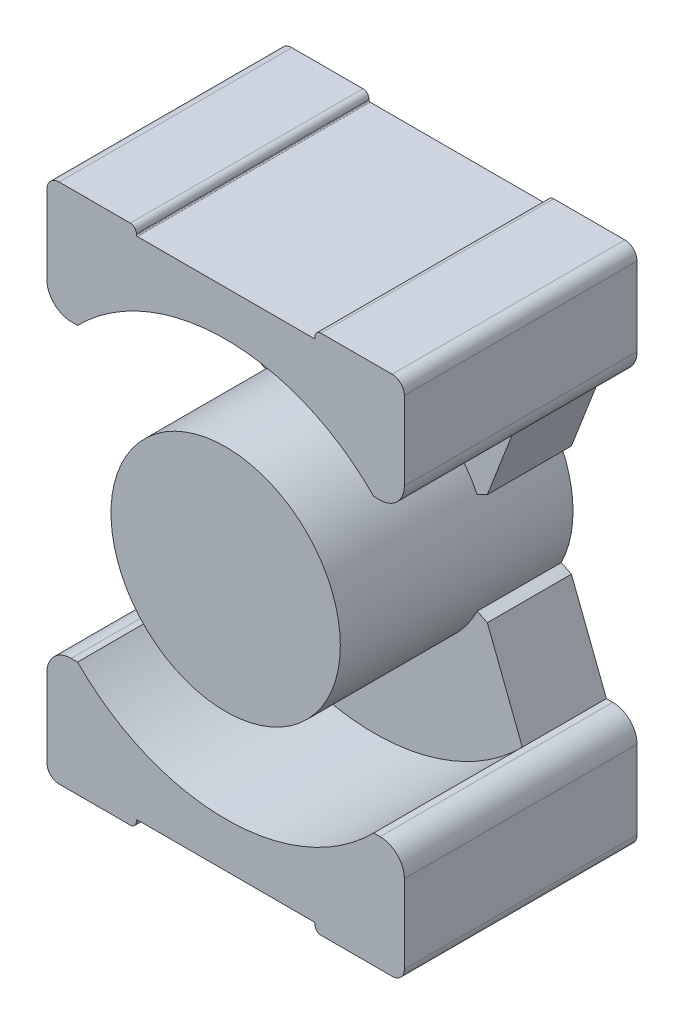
ISO-10303-21;
HEADER;
FILE_DESCRIPTION(('STEP AP214'),'2;1');
FILE_NAME('part.step','',(''),(''),'','','');
FILE_SCHEMA(('AUTOMOTIVE_DESIGN { 1 0 10303 214 1 1 1 1 }'));
ENDSEC;
DATA;
#1=APPLICATION_CONTEXT('core data for automotive mechanical design processes');
#2=APPLICATION_PROTOCOL_DEFINITION('international standard','automotive_design',2000,#1);
#3=PRODUCT_CONTEXT('',#1,'mechanical');
#4=PRODUCT('Part','Part','',(#3));
#5=PRODUCT_RELATED_PRODUCT_CATEGORY('part','',(#4));
#6=PRODUCT_DEFINITION_FORMATION('','',#4);
#7=PRODUCT_DEFINITION_CONTEXT('part definition',#1,'design');
#8=PRODUCT_DEFINITION('design','',#6,#7);
#9=PRODUCT_DEFINITION_SHAPE('','',#8);
#10=(LENGTH_UNIT() NAMED_UNIT(*) SI_UNIT(.MILLI.,.METRE.));
#11=(NAMED_UNIT(*) PLANE_ANGLE_UNIT() SI_UNIT($,.RADIAN.));
#12=(NAMED_UNIT(*) SI_UNIT($,.STERADIAN.) SOLID_ANGLE_UNIT());
#13=UNCERTAINTY_MEASURE_WITH_UNIT(LENGTH_MEASURE(1.E-05),#10,'distance_accuracy_value','');
#14=(GEOMETRIC_REPRESENTATION_CONTEXT(3) GLOBAL_UNCERTAINTY_ASSIGNED_CONTEXT((#13)) GLOBAL_UNIT_ASSIGNED_CONTEXT((#10,
#11,#12)) REPRESENTATION_CONTEXT('',''));
#15=CARTESIAN_POINT('',(0.,0.,0.));
#16=DIRECTION('',(0.,0.,1.));
#17=DIRECTION('',(1.,0.,0.));
#18=AXIS2_PLACEMENT_3D('',#15,#16,#17);
#19=CARTESIAN_POINT('',(-4.75,-13.4285172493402,-12.37));
#20=DIRECTION('',(1.,0.,0.));
#21=DIRECTION('',(0.,1.,0.));
#22=AXIS2_PLACEMENT_3D('',#19,#20,#21);
#23=PLANE('',#22);
#24=DIRECTION('',(0.,1.,0.));
#25=VECTOR('',#24,1.);
#26=CARTESIAN_POINT('',(-4.75,-13.4285172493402,-12.37));
#27=LINE('',#26,#25);
#28=CARTESIAN_POINT('',(-4.75,-13.5385172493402,-12.37));
#29=VERTEX_POINT('',#28);
#30=CARTESIAN_POINT('',(-4.75,-13.4885172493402,-12.37));
#31=VERTEX_POINT('',#30);
#32=EDGE_CURVE('E463',#29,#31,#27,.T.);
#33=ORIENTED_EDGE('',*,*,#32,.T.);
#34=DIRECTION('',(0.,0.,-1.));
#35=VECTOR('',#34,1.);
#36=CARTESIAN_POINT('',(-4.75,-13.4885172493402,-12.37));
#37=LINE('',#36,#35);
#38=CARTESIAN_POINT('',(-4.75,-13.4885172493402,0.));
#39=VERTEX_POINT('',#38);
#40=EDGE_CURVE('E363',#31,#39,#37,.F.);
#41=ORIENTED_EDGE('',*,*,#40,.T.);
#42=DIRECTION('',(0.,1.,0.));
#43=VECTOR('',#42,1.);
#44=CARTESIAN_POINT('',(-4.75,-13.4285172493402,0.));
#45=LINE('',#44,#43);
#46=CARTESIAN_POINT('',(-4.75,-13.5385172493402,0.));
#47=VERTEX_POINT('',#46);
#48=EDGE_CURVE('E466',#39,#47,#45,.F.);
#49=ORIENTED_EDGE('',*,*,#48,.T.);
#50=DIRECTION('',(0.,0.,1.));
#51=VECTOR('',#50,1.);
#52=CARTESIAN_POINT('',(-4.75,-13.5385172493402,-12.37));
#53=LINE('',#52,#51);
#54=EDGE_CURVE('E367',#29,#47,#53,.T.);
#55=ORIENTED_EDGE('',*,*,#54,.F.);
#56=EDGE_LOOP('',(#33,#41,#49,#55));
#57=FACE_BOUND('',#56,.T.);
#58=ADVANCED_FACE('F23',(#57),#23,.T.);
#59=CARTESIAN_POINT('',(4.74999999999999,-13.4285172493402,-12.37));
#60=DIRECTION('',(-1.,0.,0.));
#61=DIRECTION('',(0.,-1.,0.));
#62=AXIS2_PLACEMENT_3D('',#59,#60,#61);
#63=PLANE('',#62);
#64=DIRECTION('',(0.,-1.,0.));
#65=VECTOR('',#64,1.);
#66=CARTESIAN_POINT('',(4.74999999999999,-13.4285172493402,-12.37));
#67=LINE('',#66,#65);
#68=CARTESIAN_POINT('',(4.74999999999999,-13.4885172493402,-12.37));
#69=VERTEX_POINT('',#68);
#70=CARTESIAN_POINT('',(4.74999999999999,-13.5385172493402,-12.37));
#71=VERTEX_POINT('',#70);
#72=EDGE_CURVE('E454',#69,#71,#67,.T.);
#73=ORIENTED_EDGE('',*,*,#72,.T.);
#74=DIRECTION('',(0.,0.,1.));
#75=VECTOR('',#74,1.);
#76=CARTESIAN_POINT('',(4.74999999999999,-13.5385172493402,-12.37));
#77=LINE('',#76,#75);
#78=CARTESIAN_POINT('',(4.74999999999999,-13.5385172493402,0.));
#79=VERTEX_POINT('',#78);
#80=EDGE_CURVE('E357',#79,#71,#77,.F.);
#81=ORIENTED_EDGE('',*,*,#80,.F.);
#82=DIRECTION('',(0.,-1.,0.));
#83=VECTOR('',#82,1.);
#84=CARTESIAN_POINT('',(4.74999999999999,-13.4285172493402,0.));
#85=LINE('',#84,#83);
#86=CARTESIAN_POINT('',(4.74999999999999,-13.4885172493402,0.));
#87=VERTEX_POINT('',#86);
#88=EDGE_CURVE('E461',#79,#87,#85,.F.);
#89=ORIENTED_EDGE('',*,*,#88,.T.);
#90=DIRECTION('',(0.,0.,-1.));
#91=VECTOR('',#90,1.);
#92=CARTESIAN_POINT('',(4.74999999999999,-13.4885172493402,-12.37));
#93=LINE('',#92,#91);
#94=EDGE_CURVE('E365',#87,#69,#93,.T.);
#95=ORIENTED_EDGE('',*,*,#94,.T.);
#96=EDGE_LOOP('',(#73,#81,#89,#95));
#97=FACE_BOUND('',#96,.T.);
#98=ADVANCED_FACE('F844',(#97),#63,.T.);
#99=CARTESIAN_POINT('',(0.,0.,-7.9));
#100=DIRECTION('',(0.,0.,1.));
#101=DIRECTION('',(1.,0.,0.));
#102=AXIS2_PLACEMENT_3D('',#99,#100,#101);
#103=CYLINDRICAL_SURFACE('',#102,11.0442935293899);
#104=DIRECTION('',(0.,0.,1.));
#105=VECTOR('',#104,1.);
#106=CARTESIAN_POINT('',(7.86999999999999,-7.74851724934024,-12.37));
#107=LINE('',#106,#105);
#108=CARTESIAN_POINT('',(7.86999999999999,-7.74851724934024,-7.9));
#109=VERTEX_POINT('',#108);
#110=CARTESIAN_POINT('',(7.86999999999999,-7.74851724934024,0.));
#111=VERTEX_POINT('',#110);
#112=EDGE_CURVE('E669',#109,#111,#107,.T.);
#113=ORIENTED_EDGE('',*,*,#112,.F.);
#114=CARTESIAN_POINT('',(0.,0.,-7.9));
#115=DIRECTION('',(0.,0.,1.));
#116=DIRECTION('',(1.,0.,0.));
#117=AXIS2_PLACEMENT_3D('',#114,#115,#116);
#118=CIRCLE('',#117,11.0442935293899);
#119=CARTESIAN_POINT('',(-7.86999999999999,-7.74851724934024,-7.9));
#120=VERTEX_POINT('',#119);
#121=EDGE_CURVE('E333',#120,#109,#118,.T.);
#122=ORIENTED_EDGE('',*,*,#121,.F.);
#123=DIRECTION('',(0.,0.,1.));
#124=VECTOR('',#123,1.);
#125=CARTESIAN_POINT('',(-7.86999999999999,-7.74851724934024,-12.37));
#126=LINE('',#125,#124);
#127=CARTESIAN_POINT('',(-7.86999999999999,-7.74851724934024,0.));
#128=VERTEX_POINT('',#127);
#129=EDGE_CURVE('E377',#128,#120,#126,.F.);
#130=ORIENTED_EDGE('',*,*,#129,.F.);
#131=CARTESIAN_POINT('',(0.,0.,0.));
#132=DIRECTION('',(0.,0.,1.));
#133=DIRECTION('',(1.,0.,0.));
#134=AXIS2_PLACEMENT_3D('',#131,#132,#133);
#135=CIRCLE('',#134,11.0442935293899);
#136=EDGE_CURVE('E346',#111,#128,#135,.F.);
#137=ORIENTED_EDGE('',*,*,#136,.F.);
#138=EDGE_LOOP('',(#113,#122,#130,#137));
#139=FACE_BOUND('',#138,.T.);
#140=ADVANCED_FACE('F1275',(#139),#103,.F.);
#141=CARTESIAN_POINT('',(4.75,13.4285172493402,-12.37));
#142=DIRECTION('',(-1.,0.,0.));
#143=DIRECTION('',(0.,-1.,0.));
#144=AXIS2_PLACEMENT_3D('',#141,#142,#143);
#145=PLANE('',#144);
#146=DIRECTION('',(0.,-1.,0.));
#147=VECTOR('',#146,1.);
#148=CARTESIAN_POINT('',(4.75,13.4285172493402,-12.37));
#149=LINE('',#148,#147);
#150=CARTESIAN_POINT('',(4.75,13.5385172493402,-12.37));
#151=VERTEX_POINT('',#150);
#152=CARTESIAN_POINT('',(4.75,13.4885172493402,-12.37));
#153=VERTEX_POINT('',#152);
#154=EDGE_CURVE('E292',#151,#153,#149,.T.);
#155=ORIENTED_EDGE('',*,*,#154,.T.);
#156=DIRECTION('',(0.,0.,-1.));
#157=VECTOR('',#156,1.);
#158=CARTESIAN_POINT('',(4.75,13.4885172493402,-12.37));
#159=LINE('',#158,#157);
#160=CARTESIAN_POINT('',(4.75,13.4885172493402,0.));
#161=VERTEX_POINT('',#160);
#162=EDGE_CURVE('E320',#153,#161,#159,.F.);
#163=ORIENTED_EDGE('',*,*,#162,.T.);
#164=DIRECTION('',(0.,-1.,0.));
#165=VECTOR('',#164,1.);
#166=CARTESIAN_POINT('',(4.75,13.4285172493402,0.));
#167=LINE('',#166,#165);
#168=CARTESIAN_POINT('',(4.75,13.5385172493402,0.));
#169=VERTEX_POINT('',#168);
#170=EDGE_CURVE('E452',#161,#169,#167,.F.);
#171=ORIENTED_EDGE('',*,*,#170,.T.);
#172=DIRECTION('',(0.,0.,1.));
#173=VECTOR('',#172,1.);
#174=CARTESIAN_POINT('',(4.75,13.5385172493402,-12.37));
#175=LINE('',#174,#173);
#176=EDGE_CURVE('E325',#151,#169,#175,.T.);
#177=ORIENTED_EDGE('',*,*,#176,.F.);
#178=EDGE_LOOP('',(#155,#163,#171,#177));
#179=FACE_BOUND('',#178,.T.);
#180=ADVANCED_FACE('F751',(#179),#145,.T.);
#181=CARTESIAN_POINT('',(0.,0.,-7.9));
#182=DIRECTION('',(0.,0.,1.));
#183=DIRECTION('',(1.,0.,0.));
#184=AXIS2_PLACEMENT_3D('',#181,#182,#183);
#185=CYLINDRICAL_SURFACE('',#184,11.0442935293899);
#186=DIRECTION('',(0.,0.,-1.));
#187=VECTOR('',#186,1.);
#188=CARTESIAN_POINT('',(-7.87,7.74851724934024,-12.37));
#189=LINE('',#188,#187);
#190=CARTESIAN_POINT('',(-7.87,7.74851724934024,-7.9));
#191=VERTEX_POINT('',#190);
#192=CARTESIAN_POINT('',(-7.87,7.74851724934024,0.));
#193=VERTEX_POINT('',#192);
#194=EDGE_CURVE('E384',#191,#193,#189,.F.);
#195=ORIENTED_EDGE('',*,*,#194,.F.);
#196=CARTESIAN_POINT('',(0.,0.,-7.9));
#197=DIRECTION('',(0.,0.,1.));
#198=DIRECTION('',(1.,0.,0.));
#199=AXIS2_PLACEMENT_3D('',#196,#197,#198);
#200=CIRCLE('',#199,11.0442935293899);
#201=CARTESIAN_POINT('',(7.87,7.74851724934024,-7.9));
#202=VERTEX_POINT('',#201);
#203=EDGE_CURVE('E329',#202,#191,#200,.T.);
#204=ORIENTED_EDGE('',*,*,#203,.F.);
#205=DIRECTION('',(0.,0.,1.));
#206=VECTOR('',#205,1.);
#207=CARTESIAN_POINT('',(7.87,7.74851724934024,-12.37));
#208=LINE('',#207,#206);
#209=CARTESIAN_POINT('',(7.87,7.74851724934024,0.));
#210=VERTEX_POINT('',#209);
#211=EDGE_CURVE('E616',#210,#202,#208,.F.);
#212=ORIENTED_EDGE('',*,*,#211,.F.);
#213=CARTESIAN_POINT('',(0.,0.,0.));
#214=DIRECTION('',(0.,0.,1.));
#215=DIRECTION('',(1.,0.,0.));
#216=AXIS2_PLACEMENT_3D('',#213,#214,#215);
#217=CIRCLE('',#216,11.0442935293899);
#218=EDGE_CURVE('E312',#193,#210,#217,.F.);
#219=ORIENTED_EDGE('',*,*,#218,.F.);
#220=EDGE_LOOP('',(#195,#204,#212,#219));
#221=FACE_BOUND('',#220,.T.);
#222=ADVANCED_FACE('F1259',(#221),#185,.F.);
#223=CARTESIAN_POINT('',(-4.75,13.4285172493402,-12.37));
#224=DIRECTION('',(1.,0.,0.));
#225=DIRECTION('',(0.,0.,-1.));
#226=AXIS2_PLACEMENT_3D('',#223,#224,#225);
#227=PLANE('',#226);
#228=DIRECTION('',(0.,1.,0.));
#229=VECTOR('',#228,1.);
#230=CARTESIAN_POINT('',(-4.75,13.4285172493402,-12.37));
#231=LINE('',#230,#229);
#232=CARTESIAN_POINT('',(-4.75,13.4885172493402,-12.37));
#233=VERTEX_POINT('',#232);
#234=CARTESIAN_POINT('',(-4.75,13.5385172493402,-12.37));
#235=VERTEX_POINT('',#234);
#236=EDGE_CURVE('E286',#233,#235,#231,.T.);
#237=ORIENTED_EDGE('',*,*,#236,.T.);
#238=DIRECTION('',(0.,0.,1.));
#239=VECTOR('',#238,1.);
#240=CARTESIAN_POINT('',(-4.75,13.5385172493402,-12.37));
#241=LINE('',#240,#239);
#242=CARTESIAN_POINT('',(-4.75,13.5385172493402,0.));
#243=VERTEX_POINT('',#242);
#244=EDGE_CURVE('E288',#243,#235,#241,.F.);
#245=ORIENTED_EDGE('',*,*,#244,.F.);
#246=DIRECTION('',(0.,1.,0.));
#247=VECTOR('',#246,1.);
#248=CARTESIAN_POINT('',(-4.75,0.,0.));
#249=LINE('',#248,#247);
#250=CARTESIAN_POINT('',(-4.75,13.4885172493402,0.));
#251=VERTEX_POINT('',#250);
#252=EDGE_CURVE('E280',#251,#243,#249,.T.);
#253=ORIENTED_EDGE('',*,*,#252,.F.);
#254=DIRECTION('',(0.,0.,-1.));
#255=VECTOR('',#254,1.);
#256=CARTESIAN_POINT('',(-4.75,13.4885172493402,-12.37));
#257=LINE('',#256,#255);
#258=EDGE_CURVE('E289',#251,#233,#257,.T.);
#259=ORIENTED_EDGE('',*,*,#258,.T.);
#260=EDGE_LOOP('',(#237,#245,#253,#259));
#261=FACE_BOUND('',#260,.T.);
#262=ADVANCED_FACE('F287',(#261),#227,.T.);
#263=CARTESIAN_POINT('',(-9.5,7.74851724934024,-12.37));
#264=DIRECTION('',(0.,-1.,0.));
#265=DIRECTION('',(0.,0.,-1.));
#266=AXIS2_PLACEMENT_3D('',#263,#264,#265);
#267=PLANE('',#266);
#268=DIRECTION('',(0.,0.,1.));
#269=VECTOR('',#268,1.);
#270=CARTESIAN_POINT('',(-7.87,7.74851724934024,-12.37));
#271=LINE('',#270,#269);
#272=CARTESIAN_POINT('',(-7.87,7.74851724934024,-12.37));
#273=VERTEX_POINT('',#272);
#274=EDGE_CURVE('E406',#191,#273,#271,.F.);
#275=ORIENTED_EDGE('',*,*,#274,.F.);
#276=ORIENTED_EDGE('',*,*,#194,.T.);
#277=DIRECTION('',(1.,0.,0.));
#278=VECTOR('',#277,1.);
#279=CARTESIAN_POINT('',(0.,7.74851724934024,0.));
#280=LINE('',#279,#278);
#281=CARTESIAN_POINT('',(-8.21,7.74851724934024,0.));
#282=VERTEX_POINT('',#281);
#283=EDGE_CURVE('E314',#282,#193,#280,.T.);
#284=ORIENTED_EDGE('',*,*,#283,.F.);
#285=DIRECTION('',(0.,0.,1.));
#286=VECTOR('',#285,1.);
#287=CARTESIAN_POINT('',(-8.21,7.74851724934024,-12.37));
#288=LINE('',#287,#286);
#289=CARTESIAN_POINT('',(-8.21,7.74851724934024,-12.37));
#290=VERTEX_POINT('',#289);
#291=EDGE_CURVE('E514',#290,#282,#288,.T.);
#292=ORIENTED_EDGE('',*,*,#291,.F.);
#293=DIRECTION('',(1.,0.,0.));
#294=VECTOR('',#293,1.);
#295=CARTESIAN_POINT('',(-9.5,7.74851724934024,-12.37));
#296=LINE('',#295,#294);
#297=EDGE_CURVE('E291',#290,#273,#296,.T.);
#298=ORIENTED_EDGE('',*,*,#297,.T.);
#299=EDGE_LOOP('',(#275,#276,#284,#292,#298));
#300=FACE_BOUND('',#299,.T.);
#301=ADVANCED_FACE('F1243',(#300),#267,.T.);
#302=CARTESIAN_POINT('',(-9.5,-7.74851724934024,-12.37));
#303=DIRECTION('',(0.,1.,0.));
#304=DIRECTION('',(-1.,0.,0.));
#305=AXIS2_PLACEMENT_3D('',#302,#303,#304);
#306=PLANE('',#305);
#307=DIRECTION('',(-1.,0.,0.));
#308=VECTOR('',#307,1.);
#309=CARTESIAN_POINT('',(-9.5,-7.74851724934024,-12.37));
#310=LINE('',#309,#308);
#311=CARTESIAN_POINT('',(-7.86999999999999,-7.74851724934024,-12.37));
#312=VERTEX_POINT('',#311);
#313=CARTESIAN_POINT('',(-8.21,-7.74851724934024,-12.37));
#314=VERTEX_POINT('',#313);
#315=EDGE_CURVE('E373',#312,#314,#310,.T.);
#316=ORIENTED_EDGE('',*,*,#315,.T.);
#317=DIRECTION('',(0.,0.,1.));
#318=VECTOR('',#317,1.);
#319=CARTESIAN_POINT('',(-8.21,-7.74851724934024,-12.37));
#320=LINE('',#319,#318);
#321=CARTESIAN_POINT('',(-8.21,-7.74851724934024,0.));
#322=VERTEX_POINT('',#321);
#323=EDGE_CURVE('E511',#322,#314,#320,.F.);
#324=ORIENTED_EDGE('',*,*,#323,.F.);
#325=DIRECTION('',(1.,0.,0.));
#326=VECTOR('',#325,1.);
#327=CARTESIAN_POINT('',(0.,-7.74851724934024,0.));
#328=LINE('',#327,#326);
#329=EDGE_CURVE('E345',#128,#322,#328,.F.);
#330=ORIENTED_EDGE('',*,*,#329,.F.);
#331=ORIENTED_EDGE('',*,*,#129,.T.);
#332=DIRECTION('',(0.,0.,1.));
#333=VECTOR('',#332,1.);
#334=CARTESIAN_POINT('',(-7.87,-7.74851724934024,-12.37));
#335=LINE('',#334,#333);
#336=EDGE_CURVE('E392',#312,#120,#335,.T.);
#337=ORIENTED_EDGE('',*,*,#336,.F.);
#338=EDGE_LOOP('',(#316,#324,#330,#331,#337));
#339=FACE_BOUND('',#338,.T.);
#340=ADVANCED_FACE('F864',(#339),#306,.T.);
#341=CARTESIAN_POINT('',(-8.84999999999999,-13.2085172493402,-12.37));
#342=DIRECTION('',(0.,0.,1.));
#343=DIRECTION('',(1.,0.,0.));
#344=AXIS2_PLACEMENT_3D('',#341,#342,#343);
#345=CYLINDRICAL_SURFACE('',#344,0.65);
#346=CARTESIAN_POINT('',(-8.84999999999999,-13.2085172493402,0.));
#347=DIRECTION('',(0.,0.,1.));
#348=DIRECTION('',(1.,0.,0.));
#349=AXIS2_PLACEMENT_3D('',#346,#347,#348);
#350=CIRCLE('',#349,0.65);
#351=CARTESIAN_POINT('',(-9.49999999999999,-13.2085172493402,0.));
#352=VERTEX_POINT('',#351);
#353=CARTESIAN_POINT('',(-8.84999999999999,-13.8585172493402,0.));
#354=VERTEX_POINT('',#353);
#355=EDGE_CURVE('E343',#352,#354,#350,.T.);
#356=ORIENTED_EDGE('',*,*,#355,.F.);
#357=DIRECTION('',(0.,0.,1.));
#358=VECTOR('',#357,1.);
#359=CARTESIAN_POINT('',(-9.49999999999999,-13.2085172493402,-12.37));
#360=LINE('',#359,#358);
#361=CARTESIAN_POINT('',(-9.49999999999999,-13.2085172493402,-12.37));
#362=VERTEX_POINT('',#361);
#363=EDGE_CURVE('E593',#362,#352,#360,.T.);
#364=ORIENTED_EDGE('',*,*,#363,.F.);
#365=CARTESIAN_POINT('',(-8.84999999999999,-13.2085172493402,-12.37));
#366=DIRECTION('',(0.,0.,1.));
#367=DIRECTION('',(1.,0.,0.));
#368=AXIS2_PLACEMENT_3D('',#365,#366,#367);
#369=CIRCLE('',#368,0.65);
#370=CARTESIAN_POINT('',(-8.84999999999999,-13.8585172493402,-12.37));
#371=VERTEX_POINT('',#370);
#372=EDGE_CURVE('E26',#362,#371,#369,.T.);
#373=ORIENTED_EDGE('',*,*,#372,.T.);
#374=DIRECTION('',(0.,0.,1.));
#375=VECTOR('',#374,1.);
#376=CARTESIAN_POINT('',(-8.84999999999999,-13.8585172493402,-12.37));
#377=LINE('',#376,#375);
#378=EDGE_CURVE('E587',#354,#371,#377,.F.);
#379=ORIENTED_EDGE('',*,*,#378,.F.);
#380=EDGE_LOOP('',(#356,#364,#373,#379));
#381=FACE_BOUND('',#380,.T.);
#382=ADVANCED_FACE('F709',(#381),#345,.T.);
#383=CARTESIAN_POINT('',(-5.07,-13.5385172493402,-12.37));
#384=DIRECTION('',(0.,0.,1.));
#385=DIRECTION('',(1.,0.,0.));
#386=AXIS2_PLACEMENT_3D('',#383,#384,#385);
#387=CYLINDRICAL_SURFACE('',#386,0.32);
#388=CARTESIAN_POINT('',(-5.07,-13.5385172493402,0.));
#389=DIRECTION('',(0.,0.,1.));
#390=DIRECTION('',(1.,0.,0.));
#391=AXIS2_PLACEMENT_3D('',#388,#389,#390);
#392=CIRCLE('',#391,0.32);
#393=CARTESIAN_POINT('',(-5.07,-13.8585172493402,0.));
#394=VERTEX_POINT('',#393);
#395=EDGE_CURVE('E340',#394,#47,#392,.T.);
#396=ORIENTED_EDGE('',*,*,#395,.F.);
#397=DIRECTION('',(0.,0.,1.));
#398=VECTOR('',#397,1.);
#399=CARTESIAN_POINT('',(-5.07,-13.8585172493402,-12.37));
#400=LINE('',#399,#398);
#401=CARTESIAN_POINT('',(-5.07,-13.8585172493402,-12.37));
#402=VERTEX_POINT('',#401);
#403=EDGE_CURVE('E586',#402,#394,#400,.T.);
#404=ORIENTED_EDGE('',*,*,#403,.F.);
#405=CARTESIAN_POINT('',(-5.07,-13.5385172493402,-12.37));
#406=DIRECTION('',(0.,0.,1.));
#407=DIRECTION('',(1.,0.,0.));
#408=AXIS2_PLACEMENT_3D('',#405,#406,#407);
#409=CIRCLE('',#408,0.32);
#410=EDGE_CURVE('E366',#402,#29,#409,.T.);
#411=ORIENTED_EDGE('',*,*,#410,.T.);
#412=ORIENTED_EDGE('',*,*,#54,.T.);
#413=EDGE_LOOP('',(#396,#404,#411,#412));
#414=FACE_BOUND('',#413,.T.);
#415=ADVANCED_FACE('F855',(#414),#387,.T.);
#416=CARTESIAN_POINT('',(4.68999999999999,-13.4885172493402,-12.37));
#417=DIRECTION('',(0.,0.,-1.));
#418=DIRECTION('',(-1.,0.,0.));
#419=AXIS2_PLACEMENT_3D('',#416,#417,#418);
#420=CYLINDRICAL_SURFACE('',#419,0.0600000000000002);
#421=ORIENTED_EDGE('',*,*,#94,.F.);
#422=CARTESIAN_POINT('',(4.68999999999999,-13.4885172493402,0.));
#423=DIRECTION('',(0.,0.,-1.));
#424=DIRECTION('',(-1.,0.,0.));
#425=AXIS2_PLACEMENT_3D('',#422,#423,#424);
#426=CIRCLE('',#425,0.0600000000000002);
#427=CARTESIAN_POINT('',(4.68999999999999,-13.4285172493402,0.));
#428=VERTEX_POINT('',#427);
#429=EDGE_CURVE('E352',#428,#87,#426,.T.);
#430=ORIENTED_EDGE('',*,*,#429,.F.);
#431=DIRECTION('',(0.,0.,1.));
#432=VECTOR('',#431,1.);
#433=CARTESIAN_POINT('',(4.68999999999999,-13.4285172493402,-12.37));
#434=LINE('',#433,#432);
#435=CARTESIAN_POINT('',(4.68999999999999,-13.4285172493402,-12.37));
#436=VERTEX_POINT('',#435);
#437=EDGE_CURVE('E584',#436,#428,#434,.T.);
#438=ORIENTED_EDGE('',*,*,#437,.F.);
#439=CARTESIAN_POINT('',(4.68999999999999,-13.4885172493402,-12.37));
#440=DIRECTION('',(0.,0.,-1.));
#441=DIRECTION('',(-1.,0.,0.));
#442=AXIS2_PLACEMENT_3D('',#439,#440,#441);
#443=CIRCLE('',#442,0.0600000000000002);
#444=EDGE_CURVE('E364',#69,#436,#443,.F.);
#445=ORIENTED_EDGE('',*,*,#444,.F.);
#446=EDGE_LOOP('',(#421,#430,#438,#445));
#447=FACE_BOUND('',#446,.T.);
#448=ADVANCED_FACE('F842',(#447),#420,.F.);
#449=CARTESIAN_POINT('',(-4.69,-13.4885172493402,-12.37));
#450=DIRECTION('',(0.,0.,-1.));
#451=DIRECTION('',(-1.,0.,0.));
#452=AXIS2_PLACEMENT_3D('',#449,#450,#451);
#453=CYLINDRICAL_SURFACE('',#452,0.0600000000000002);
#454=DIRECTION('',(0.,0.,1.));
#455=VECTOR('',#454,1.);
#456=CARTESIAN_POINT('',(-4.69,-13.4285172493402,-12.37));
#457=LINE('',#456,#455);
#458=CARTESIAN_POINT('',(-4.69,-13.4285172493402,0.));
#459=VERTEX_POINT('',#458);
#460=CARTESIAN_POINT('',(-4.69,-13.4285172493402,-12.37));
#461=VERTEX_POINT('',#460);
#462=EDGE_CURVE('E580',#459,#461,#457,.F.);
#463=ORIENTED_EDGE('',*,*,#462,.F.);
#464=CARTESIAN_POINT('',(-4.69,-13.4885172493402,0.));
#465=DIRECTION('',(0.,0.,-1.));
#466=DIRECTION('',(-1.,0.,0.));
#467=AXIS2_PLACEMENT_3D('',#464,#465,#466);
#468=CIRCLE('',#467,0.0600000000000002);
#469=EDGE_CURVE('E337',#39,#459,#468,.T.);
#470=ORIENTED_EDGE('',*,*,#469,.F.);
#471=ORIENTED_EDGE('',*,*,#40,.F.);
#472=CARTESIAN_POINT('',(-4.69,-13.4885172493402,-12.37));
#473=DIRECTION('',(0.,0.,-1.));
#474=DIRECTION('',(-1.,0.,0.));
#475=AXIS2_PLACEMENT_3D('',#472,#473,#474);
#476=CIRCLE('',#475,0.0600000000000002);
#477=EDGE_CURVE('E360',#461,#31,#476,.F.);
#478=ORIENTED_EDGE('',*,*,#477,.F.);
#479=EDGE_LOOP('',(#463,#470,#471,#478));
#480=FACE_BOUND('',#479,.T.);
#481=ADVANCED_FACE('F851',(#480),#453,.F.);
#482=CARTESIAN_POINT('',(5.06999999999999,-13.5385172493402,-12.37));
#483=DIRECTION('',(0.,0.,1.));
#484=DIRECTION('',(1.,0.,0.));
#485=AXIS2_PLACEMENT_3D('',#482,#483,#484);
#486=CYLINDRICAL_SURFACE('',#485,0.32);
#487=CARTESIAN_POINT('',(5.06999999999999,-13.5385172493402,0.));
#488=DIRECTION('',(0.,0.,1.));
#489=DIRECTION('',(1.,0.,0.));
#490=AXIS2_PLACEMENT_3D('',#487,#488,#489);
#491=CIRCLE('',#490,0.32);
#492=CARTESIAN_POINT('',(5.06999999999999,-13.8585172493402,0.));
#493=VERTEX_POINT('',#492);
#494=EDGE_CURVE('E350',#79,#493,#491,.T.);
#495=ORIENTED_EDGE('',*,*,#494,.F.);
#496=ORIENTED_EDGE('',*,*,#80,.T.);
#497=CARTESIAN_POINT('',(5.06999999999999,-13.5385172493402,-12.37));
#498=DIRECTION('',(0.,0.,1.));
#499=DIRECTION('',(1.,0.,0.));
#500=AXIS2_PLACEMENT_3D('',#497,#498,#499);
#501=CIRCLE('',#500,0.32);
#502=CARTESIAN_POINT('',(5.06999999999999,-13.8585172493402,-12.37));
#503=VERTEX_POINT('',#502);
#504=EDGE_CURVE('E358',#71,#503,#501,.T.);
#505=ORIENTED_EDGE('',*,*,#504,.T.);
#506=DIRECTION('',(0.,0.,1.));
#507=VECTOR('',#506,1.);
#508=CARTESIAN_POINT('',(5.06999999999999,-13.8585172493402,-12.37));
#509=LINE('',#508,#507);
#510=EDGE_CURVE('E573',#493,#503,#509,.F.);
#511=ORIENTED_EDGE('',*,*,#510,.F.);
#512=EDGE_LOOP('',(#495,#496,#505,#511));
#513=FACE_BOUND('',#512,.T.);
#514=ADVANCED_FACE('F834',(#513),#486,.T.);
#515=CARTESIAN_POINT('',(8.84999999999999,-13.2085172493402,-12.37));
#516=DIRECTION('',(0.,0.,1.));
#517=DIRECTION('',(1.,0.,0.));
#518=AXIS2_PLACEMENT_3D('',#515,#516,#517);
#519=CYLINDRICAL_SURFACE('',#518,0.65);
#520=CARTESIAN_POINT('',(8.84999999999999,-13.2085172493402,0.));
#521=DIRECTION('',(0.,0.,1.));
#522=DIRECTION('',(1.,0.,0.));
#523=AXIS2_PLACEMENT_3D('',#520,#521,#522);
#524=CIRCLE('',#523,0.65);
#525=CARTESIAN_POINT('',(8.84999999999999,-13.8585172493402,0.));
#526=VERTEX_POINT('',#525);
#527=CARTESIAN_POINT('',(9.49999999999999,-13.2085172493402,0.));
#528=VERTEX_POINT('',#527);
#529=EDGE_CURVE('E348',#526,#528,#524,.T.);
#530=ORIENTED_EDGE('',*,*,#529,.F.);
#531=DIRECTION('',(0.,0.,1.));
#532=VECTOR('',#531,1.);
#533=CARTESIAN_POINT('',(8.84999999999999,-13.8585172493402,-12.37));
#534=LINE('',#533,#532);
#535=CARTESIAN_POINT('',(8.84999999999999,-13.8585172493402,-12.37));
#536=VERTEX_POINT('',#535);
#537=EDGE_CURVE('E576',#536,#526,#534,.T.);
#538=ORIENTED_EDGE('',*,*,#537,.F.);
#539=CARTESIAN_POINT('',(8.84999999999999,-13.2085172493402,-12.37));
#540=DIRECTION('',(0.,0.,1.));
#541=DIRECTION('',(1.,0.,0.));
#542=AXIS2_PLACEMENT_3D('',#539,#540,#541);
#543=CIRCLE('',#542,0.65);
#544=CARTESIAN_POINT('',(9.49999999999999,-13.2085172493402,-12.37));
#545=VERTEX_POINT('',#544);
#546=EDGE_CURVE('E355',#536,#545,#543,.T.);
#547=ORIENTED_EDGE('',*,*,#546,.T.);
#548=DIRECTION('',(0.,0.,1.));
#549=VECTOR('',#548,1.);
#550=CARTESIAN_POINT('',(9.49999999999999,-13.2085172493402,-12.37));
#551=LINE('',#550,#549);
#552=EDGE_CURVE('E569',#528,#545,#551,.F.);
#553=ORIENTED_EDGE('',*,*,#552,.F.);
#554=EDGE_LOOP('',(#530,#538,#547,#553));
#555=FACE_BOUND('',#554,.T.);
#556=ADVANCED_FACE('F827',(#555),#519,.T.);
#557=CARTESIAN_POINT('',(0.,0.,0.));
#558=DIRECTION('',(0.,0.,1.));
#559=DIRECTION('',(1.,0.,0.));
#560=AXIS2_PLACEMENT_3D('',#557,#558,#559);
#561=PLANE('',#560);
#562=ORIENTED_EDGE('',*,*,#48,.F.);
#563=ORIENTED_EDGE('',*,*,#469,.T.);
#564=DIRECTION('',(1.,0.,0.));
#565=VECTOR('',#564,1.);
#566=CARTESIAN_POINT('',(-4.75,-13.4285172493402,0.));
#567=LINE('',#566,#565);
#568=EDGE_CURVE('E583',#428,#459,#567,.F.);
#569=ORIENTED_EDGE('',*,*,#568,.F.);
#570=ORIENTED_EDGE('',*,*,#429,.T.);
#571=ORIENTED_EDGE('',*,*,#88,.F.);
#572=ORIENTED_EDGE('',*,*,#494,.T.);
#573=DIRECTION('',(1.,0.,0.));
#574=VECTOR('',#573,1.);
#575=CARTESIAN_POINT('',(4.74999999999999,-13.8585172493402,0.));
#576=LINE('',#575,#574);
#577=EDGE_CURVE('E577',#526,#493,#576,.F.);
#578=ORIENTED_EDGE('',*,*,#577,.F.);
#579=ORIENTED_EDGE('',*,*,#529,.T.);
#580=DIRECTION('',(0.,1.,0.));
#581=VECTOR('',#580,1.);
#582=CARTESIAN_POINT('',(9.49999999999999,-13.8585172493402,0.));
#583=LINE('',#582,#581);
#584=CARTESIAN_POINT('',(9.49999999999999,-9.03851724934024,0.));
#585=VERTEX_POINT('',#584);
#586=EDGE_CURVE('E572',#585,#528,#583,.F.);
#587=ORIENTED_EDGE('',*,*,#586,.F.);
#588=CARTESIAN_POINT('',(8.21,-9.03851724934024,0.));
#589=DIRECTION('',(0.,0.,1.));
#590=DIRECTION('',(1.,0.,0.));
#591=AXIS2_PLACEMENT_3D('',#588,#589,#590);
#592=CIRCLE('',#591,1.29);
#593=CARTESIAN_POINT('',(8.21,-7.74851724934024,0.));
#594=VERTEX_POINT('',#593);
#595=EDGE_CURVE('E505',#594,#585,#592,.F.);
#596=ORIENTED_EDGE('',*,*,#595,.F.);
#597=DIRECTION('',(-1.,0.,0.));
#598=VECTOR('',#597,1.);
#599=CARTESIAN_POINT('',(9.49999999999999,-7.74851724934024,0.));
#600=LINE('',#599,#598);
#601=EDGE_CURVE('E339',#111,#594,#600,.F.);
#602=ORIENTED_EDGE('',*,*,#601,.F.);
#603=ORIENTED_EDGE('',*,*,#136,.T.);
#604=ORIENTED_EDGE('',*,*,#329,.T.);
#605=CARTESIAN_POINT('',(-8.21,-9.03851724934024,0.));
#606=DIRECTION('',(0.,0.,1.));
#607=DIRECTION('',(1.,0.,0.));
#608=AXIS2_PLACEMENT_3D('',#605,#606,#607);
#609=CIRCLE('',#608,1.29);
#610=CARTESIAN_POINT('',(-9.5,-9.03851724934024,0.));
#611=VERTEX_POINT('',#610);
#612=EDGE_CURVE('E401',#611,#322,#609,.F.);
#613=ORIENTED_EDGE('',*,*,#612,.F.);
#614=DIRECTION('',(0.,-1.,0.));
#615=VECTOR('',#614,1.);
#616=CARTESIAN_POINT('',(-9.49999999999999,-13.8585172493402,0.));
#617=LINE('',#616,#615);
#618=EDGE_CURVE('E388',#352,#611,#617,.F.);
#619=ORIENTED_EDGE('',*,*,#618,.F.);
#620=ORIENTED_EDGE('',*,*,#355,.T.);
#621=DIRECTION('',(1.,0.,0.));
#622=VECTOR('',#621,1.);
#623=CARTESIAN_POINT('',(-4.75,-13.8585172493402,0.));
#624=LINE('',#623,#622);
#625=EDGE_CURVE('E589',#394,#354,#624,.F.);
#626=ORIENTED_EDGE('',*,*,#625,.F.);
#627=ORIENTED_EDGE('',*,*,#395,.T.);
#628=EDGE_LOOP('',(#562,#563,#569,#570,#571,#572,#578,#579,#587,#596,#602,#603,#604,#613,#619,
#620,#626,#627));
#629=FACE_BOUND('',#628,.T.);
#630=ADVANCED_FACE('F713',(#629),#561,.T.);
#631=CARTESIAN_POINT('',(9.49999999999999,-7.74851724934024,-12.37));
#632=DIRECTION('',(0.,1.,0.));
#633=DIRECTION('',(-1.,0.,0.));
#634=AXIS2_PLACEMENT_3D('',#631,#632,#633);
#635=PLANE('',#634);
#636=DIRECTION('',(0.,0.,1.));
#637=VECTOR('',#636,1.);
#638=CARTESIAN_POINT('',(7.87,-7.74851724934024,-12.37));
#639=LINE('',#638,#637);
#640=CARTESIAN_POINT('',(7.86999999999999,-7.74851724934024,-12.37));
#641=VERTEX_POINT('',#640);
#642=EDGE_CURVE('E598',#109,#641,#639,.F.);
#643=ORIENTED_EDGE('',*,*,#642,.F.);
#644=ORIENTED_EDGE('',*,*,#112,.T.);
#645=ORIENTED_EDGE('',*,*,#601,.T.);
#646=DIRECTION('',(0.,0.,1.));
#647=VECTOR('',#646,1.);
#648=CARTESIAN_POINT('',(8.21,-7.74851724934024,-12.37));
#649=LINE('',#648,#647);
#650=CARTESIAN_POINT('',(8.21,-7.74851724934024,-12.37));
#651=VERTEX_POINT('',#650);
#652=EDGE_CURVE('E508',#651,#594,#649,.T.);
#653=ORIENTED_EDGE('',*,*,#652,.F.);
#654=DIRECTION('',(-1.,0.,0.));
#655=VECTOR('',#654,1.);
#656=CARTESIAN_POINT('',(9.49999999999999,-7.74851724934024,-12.37));
#657=LINE('',#656,#655);
#658=EDGE_CURVE('E674',#651,#641,#657,.T.);
#659=ORIENTED_EDGE('',*,*,#658,.T.);
#660=EDGE_LOOP('',(#643,#644,#645,#653,#659));
#661=FACE_BOUND('',#660,.T.);
#662=ADVANCED_FACE('F813',(#661),#635,.T.);
#663=CARTESIAN_POINT('',(-5.47,-2.68851724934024,-12.37));
#664=DIRECTION('',(-0.433815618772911,0.901001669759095,0.));
#665=DIRECTION('',(-0.901001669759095,-0.433815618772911,0.));
#666=AXIS2_PLACEMENT_3D('',#663,#664,#665);
#667=PLANE('',#666);
#668=DIRECTION('',(0.,0.,1.));
#669=VECTOR('',#668,1.);
#670=CARTESIAN_POINT('',(-6.01,-2.94851724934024,-12.37));
#671=LINE('',#670,#669);
#672=CARTESIAN_POINT('',(-6.01,-2.94851724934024,-7.9));
#673=VERTEX_POINT('',#672);
#674=CARTESIAN_POINT('',(-6.01,-2.94851724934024,-12.37));
#675=VERTEX_POINT('',#674);
#676=EDGE_CURVE('E396',#673,#675,#671,.F.);
#677=ORIENTED_EDGE('',*,*,#676,.F.);
#678=DIRECTION('',(-0.901001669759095,-0.433815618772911,0.));
#679=VECTOR('',#678,1.);
#680=CARTESIAN_POINT('',(-5.47,-2.68851724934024,-7.9));
#681=LINE('',#680,#679);
#682=CARTESIAN_POINT('',(-5.47,-2.68851724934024,-7.9));
#683=VERTEX_POINT('',#682);
#684=EDGE_CURVE('E336',#683,#673,#681,.T.);
#685=ORIENTED_EDGE('',*,*,#684,.F.);
#686=DIRECTION('',(0.,0.,1.));
#687=VECTOR('',#686,1.);
#688=CARTESIAN_POINT('',(-5.47,-2.68851724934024,-12.37));
#689=LINE('',#688,#687);
#690=CARTESIAN_POINT('',(-5.47,-2.68851724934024,-12.37));
#691=VERTEX_POINT('',#690);
#692=EDGE_CURVE('E504',#691,#683,#689,.T.);
#693=ORIENTED_EDGE('',*,*,#692,.F.);
#694=DIRECTION('',(-0.901001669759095,-0.433815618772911,0.));
#695=VECTOR('',#694,1.);
#696=CARTESIAN_POINT('',(-5.47,-2.68851724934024,-12.37));
#697=LINE('',#696,#695);
#698=EDGE_CURVE('E664',#691,#675,#697,.T.);
#699=ORIENTED_EDGE('',*,*,#698,.T.);
#700=EDGE_LOOP('',(#677,#685,#693,#699));
#701=FACE_BOUND('',#700,.T.);
#702=ADVANCED_FACE('F963',(#701),#667,.T.);
#703=CARTESIAN_POINT('',(0.,0.,-7.9));
#704=DIRECTION('',(0.,0.,1.));
#705=DIRECTION('',(1.,0.,0.));
#706=AXIS2_PLACEMENT_3D('',#703,#704,#705);
#707=PLANE('',#706);
#708=DIRECTION('',(-0.361321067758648,0.932441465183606,0.));
#709=VECTOR('',#708,1.);
#710=CARTESIAN_POINT('',(6.01,-2.94851724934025,-7.9));
#711=LINE('',#710,#709);
#712=CARTESIAN_POINT('',(6.01,-2.94851724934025,-7.9));
#713=VERTEX_POINT('',#712);
#714=EDGE_CURVE('E675',#713,#109,#711,.F.);
#715=ORIENTED_EDGE('',*,*,#714,.F.);
#716=DIRECTION('',(-0.901001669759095,0.433815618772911,0.));
#717=VECTOR('',#716,1.);
#718=CARTESIAN_POINT('',(5.47,-2.68851724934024,-7.9));
#719=LINE('',#718,#717);
#720=CARTESIAN_POINT('',(5.47,-2.68851724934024,-7.9));
#721=VERTEX_POINT('',#720);
#722=EDGE_CURVE('E335',#721,#713,#719,.F.);
#723=ORIENTED_EDGE('',*,*,#722,.F.);
#724=CARTESIAN_POINT('',(0.,0.,-7.9));
#725=DIRECTION('',(0.,0.,1.));
#726=DIRECTION('',(1.,0.,0.));
#727=AXIS2_PLACEMENT_3D('',#724,#725,#726);
#728=CIRCLE('',#727,6.095);
#729=EDGE_CURVE('E502',#683,#721,#728,.T.);
#730=ORIENTED_EDGE('',*,*,#729,.F.);
#731=ORIENTED_EDGE('',*,*,#684,.T.);
#732=DIRECTION('',(-0.361321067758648,-0.932441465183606,0.));
#733=VECTOR('',#732,1.);
#734=CARTESIAN_POINT('',(-6.01,-2.94851724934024,-7.9));
#735=LINE('',#734,#733);
#736=EDGE_CURVE('E395',#120,#673,#735,.F.);
#737=ORIENTED_EDGE('',*,*,#736,.F.);
#738=ORIENTED_EDGE('',*,*,#121,.T.);
#739=EDGE_LOOP('',(#715,#723,#730,#731,#737,#738));
#740=FACE_BOUND('',#739,.T.);
#741=ADVANCED_FACE('F959',(#740),#707,.T.);
#742=CARTESIAN_POINT('',(5.47,-2.68851724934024,-12.37));
#743=DIRECTION('',(0.433815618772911,0.901001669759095,0.));
#744=DIRECTION('',(-0.901001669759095,0.433815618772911,0.));
#745=AXIS2_PLACEMENT_3D('',#742,#743,#744);
#746=PLANE('',#745);
#747=DIRECTION('',(0.,0.,1.));
#748=VECTOR('',#747,1.);
#749=CARTESIAN_POINT('',(6.01,-2.94851724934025,-12.37));
#750=LINE('',#749,#748);
#751=CARTESIAN_POINT('',(6.01,-2.94851724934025,-12.37));
#752=VERTEX_POINT('',#751);
#753=EDGE_CURVE('E566',#752,#713,#750,.T.);
#754=ORIENTED_EDGE('',*,*,#753,.F.);
#755=DIRECTION('',(-0.901001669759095,0.433815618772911,0.));
#756=VECTOR('',#755,1.);
#757=CARTESIAN_POINT('',(5.47,-2.68851724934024,-12.37));
#758=LINE('',#757,#756);
#759=CARTESIAN_POINT('',(5.47,-2.68851724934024,-12.37));
#760=VERTEX_POINT('',#759);
#761=EDGE_CURVE('E651',#752,#760,#758,.T.);
#762=ORIENTED_EDGE('',*,*,#761,.T.);
#763=DIRECTION('',(0.,0.,1.));
#764=VECTOR('',#763,1.);
#765=CARTESIAN_POINT('',(5.47,-2.68851724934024,-12.37));
#766=LINE('',#765,#764);
#767=EDGE_CURVE('E501',#721,#760,#766,.F.);
#768=ORIENTED_EDGE('',*,*,#767,.F.);
#769=ORIENTED_EDGE('',*,*,#722,.T.);
#770=EDGE_LOOP('',(#754,#762,#768,#769));
#771=FACE_BOUND('',#770,.T.);
#772=ADVANCED_FACE('F955',(#771),#746,.T.);
#773=CARTESIAN_POINT('',(0.,0.,0.));
#774=DIRECTION('',(0.,0.,1.));
#775=DIRECTION('',(1.,0.,0.));
#776=AXIS2_PLACEMENT_3D('',#773,#774,#775);
#777=PLANE('',#776);
#778=CARTESIAN_POINT('',(0.,0.,0.));
#779=DIRECTION('',(0.,0.,1.));
#780=DIRECTION('',(1.,0.,0.));
#781=AXIS2_PLACEMENT_3D('',#778,#779,#780);
#782=CIRCLE('',#781,6.095);
#783=CARTESIAN_POINT('',(6.095,0.,0.));
#784=VERTEX_POINT('',#783);
#785=EDGE_CURVE('E498',#784,#784,#782,.F.);
#786=ORIENTED_EDGE('',*,*,#785,.F.);
#787=EDGE_LOOP('',(#786));
#788=FACE_BOUND('',#787,.T.);
#789=ADVANCED_FACE('F951',(#788),#777,.T.);
#790=CARTESIAN_POINT('',(-5.47,2.68851724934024,-12.37));
#791=DIRECTION('',(-0.43381561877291,-0.901001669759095,0.));
#792=DIRECTION('',(0.901001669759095,-0.43381561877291,0.));
#793=AXIS2_PLACEMENT_3D('',#790,#791,#792);
#794=PLANE('',#793);
#795=DIRECTION('',(0.,0.,1.));
#796=VECTOR('',#795,1.);
#797=CARTESIAN_POINT('',(-6.01,2.94851724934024,-12.37));
#798=LINE('',#797,#796);
#799=CARTESIAN_POINT('',(-6.01,2.94851724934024,-12.37));
#800=VERTEX_POINT('',#799);
#801=CARTESIAN_POINT('',(-6.01,2.94851724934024,-7.9));
#802=VERTEX_POINT('',#801);
#803=EDGE_CURVE('E420',#800,#802,#798,.T.);
#804=ORIENTED_EDGE('',*,*,#803,.F.);
#805=DIRECTION('',(0.901001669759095,-0.43381561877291,0.));
#806=VECTOR('',#805,1.);
#807=CARTESIAN_POINT('',(-5.47,2.68851724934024,-12.37));
#808=LINE('',#807,#806);
#809=CARTESIAN_POINT('',(-5.47,2.68851724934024,-12.37));
#810=VERTEX_POINT('',#809);
#811=EDGE_CURVE('E647',#800,#810,#808,.T.);
#812=ORIENTED_EDGE('',*,*,#811,.T.);
#813=DIRECTION('',(0.,0.,1.));
#814=VECTOR('',#813,1.);
#815=CARTESIAN_POINT('',(-5.47,2.68851724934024,-12.37));
#816=LINE('',#815,#814);
#817=CARTESIAN_POINT('',(-5.47,2.68851724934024,-7.9));
#818=VERTEX_POINT('',#817);
#819=EDGE_CURVE('E496',#818,#810,#816,.F.);
#820=ORIENTED_EDGE('',*,*,#819,.F.);
#821=DIRECTION('',(0.901001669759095,-0.43381561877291,0.));
#822=VECTOR('',#821,1.);
#823=CARTESIAN_POINT('',(-6.01,2.94851724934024,-7.9));
#824=LINE('',#823,#822);
#825=EDGE_CURVE('E331',#802,#818,#824,.T.);
#826=ORIENTED_EDGE('',*,*,#825,.F.);
#827=EDGE_LOOP('',(#804,#812,#820,#826));
#828=FACE_BOUND('',#827,.T.);
#829=ADVANCED_FACE('F947',(#828),#794,.T.);
#830=CARTESIAN_POINT('',(5.47,2.68851724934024,-12.37));
#831=DIRECTION('',(0.43381561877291,-0.901001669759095,0.));
#832=DIRECTION('',(0.901001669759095,0.43381561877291,0.));
#833=AXIS2_PLACEMENT_3D('',#830,#831,#832);
#834=PLANE('',#833);
#835=DIRECTION('',(0.,0.,1.));
#836=VECTOR('',#835,1.);
#837=CARTESIAN_POINT('',(6.01,2.94851724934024,-12.37));
#838=LINE('',#837,#836);
#839=CARTESIAN_POINT('',(6.01,2.94851724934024,-7.9));
#840=VERTEX_POINT('',#839);
#841=CARTESIAN_POINT('',(6.01,2.94851724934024,-12.37));
#842=VERTEX_POINT('',#841);
#843=EDGE_CURVE('E601',#840,#842,#838,.F.);
#844=ORIENTED_EDGE('',*,*,#843,.F.);
#845=DIRECTION('',(0.901001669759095,0.43381561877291,0.));
#846=VECTOR('',#845,1.);
#847=CARTESIAN_POINT('',(5.47,2.68851724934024,-7.9));
#848=LINE('',#847,#846);
#849=CARTESIAN_POINT('',(5.47,2.68851724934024,-7.9));
#850=VERTEX_POINT('',#849);
#851=EDGE_CURVE('E332',#850,#840,#848,.T.);
#852=ORIENTED_EDGE('',*,*,#851,.F.);
#853=DIRECTION('',(0.,0.,1.));
#854=VECTOR('',#853,1.);
#855=CARTESIAN_POINT('',(5.47,2.68851724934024,-12.37));
#856=LINE('',#855,#854);
#857=CARTESIAN_POINT('',(5.47,2.68851724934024,-12.37));
#858=VERTEX_POINT('',#857);
#859=EDGE_CURVE('E497',#858,#850,#856,.T.);
#860=ORIENTED_EDGE('',*,*,#859,.F.);
#861=DIRECTION('',(0.901001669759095,0.43381561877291,0.));
#862=VECTOR('',#861,1.);
#863=CARTESIAN_POINT('',(5.47,2.68851724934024,-12.37));
#864=LINE('',#863,#862);
#865=EDGE_CURVE('E624',#858,#842,#864,.T.);
#866=ORIENTED_EDGE('',*,*,#865,.T.);
#867=EDGE_LOOP('',(#844,#852,#860,#866));
#868=FACE_BOUND('',#867,.T.);
#869=ADVANCED_FACE('F943',(#868),#834,.T.);
#870=CARTESIAN_POINT('',(0.,0.,-7.9));
#871=DIRECTION('',(0.,0.,1.));
#872=DIRECTION('',(1.,0.,0.));
#873=AXIS2_PLACEMENT_3D('',#870,#871,#872);
#874=PLANE('',#873);
#875=DIRECTION('',(0.361321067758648,-0.932441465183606,0.));
#876=VECTOR('',#875,1.);
#877=CARTESIAN_POINT('',(-6.01,2.94851724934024,-7.9));
#878=LINE('',#877,#876);
#879=EDGE_CURVE('E417',#802,#191,#878,.F.);
#880=ORIENTED_EDGE('',*,*,#879,.F.);
#881=ORIENTED_EDGE('',*,*,#825,.T.);
#882=CARTESIAN_POINT('',(0.,0.,-7.9));
#883=DIRECTION('',(0.,0.,1.));
#884=DIRECTION('',(1.,0.,0.));
#885=AXIS2_PLACEMENT_3D('',#882,#883,#884);
#886=CIRCLE('',#885,6.095);
#887=EDGE_CURVE('E493',#850,#818,#886,.T.);
#888=ORIENTED_EDGE('',*,*,#887,.F.);
#889=ORIENTED_EDGE('',*,*,#851,.T.);
#890=DIRECTION('',(0.361321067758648,0.932441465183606,0.));
#891=VECTOR('',#890,1.);
#892=CARTESIAN_POINT('',(6.01,2.94851724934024,-7.9));
#893=LINE('',#892,#891);
#894=EDGE_CURVE('E492',#202,#840,#893,.F.);
#895=ORIENTED_EDGE('',*,*,#894,.F.);
#896=ORIENTED_EDGE('',*,*,#203,.T.);
#897=EDGE_LOOP('',(#880,#881,#888,#889,#895,#896));
#898=FACE_BOUND('',#897,.T.);
#899=ADVANCED_FACE('F940',(#898),#874,.T.);
#900=CARTESIAN_POINT('',(9.5,7.74851724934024,-12.37));
#901=DIRECTION('',(0.,-1.,0.));
#902=DIRECTION('',(1.,0.,0.));
#903=AXIS2_PLACEMENT_3D('',#900,#901,#902);
#904=PLANE('',#903);
#905=DIRECTION('',(1.,0.,0.));
#906=VECTOR('',#905,1.);
#907=CARTESIAN_POINT('',(9.5,7.74851724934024,-12.37));
#908=LINE('',#907,#906);
#909=CARTESIAN_POINT('',(7.87,7.74851724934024,-12.37));
#910=VERTEX_POINT('',#909);
#911=CARTESIAN_POINT('',(8.21,7.74851724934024,-12.37));
#912=VERTEX_POINT('',#911);
#913=EDGE_CURVE('E328',#910,#912,#908,.T.);
#914=ORIENTED_EDGE('',*,*,#913,.T.);
#915=DIRECTION('',(0.,0.,1.));
#916=VECTOR('',#915,1.);
#917=CARTESIAN_POINT('',(8.21,7.74851724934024,-12.37));
#918=LINE('',#917,#916);
#919=CARTESIAN_POINT('',(8.21,7.74851724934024,0.));
#920=VERTEX_POINT('',#919);
#921=EDGE_CURVE('E491',#920,#912,#918,.F.);
#922=ORIENTED_EDGE('',*,*,#921,.F.);
#923=DIRECTION('',(1.,0.,0.));
#924=VECTOR('',#923,1.);
#925=CARTESIAN_POINT('',(0.,7.74851724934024,0.));
#926=LINE('',#925,#924);
#927=EDGE_CURVE('E311',#210,#920,#926,.T.);
#928=ORIENTED_EDGE('',*,*,#927,.F.);
#929=ORIENTED_EDGE('',*,*,#211,.T.);
#930=DIRECTION('',(0.,0.,1.));
#931=VECTOR('',#930,1.);
#932=CARTESIAN_POINT('',(7.87,7.74851724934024,-12.37));
#933=LINE('',#932,#931);
#934=EDGE_CURVE('E627',#910,#202,#933,.T.);
#935=ORIENTED_EDGE('',*,*,#934,.F.);
#936=EDGE_LOOP('',(#914,#922,#928,#929,#935));
#937=FACE_BOUND('',#936,.T.);
#938=ADVANCED_FACE('F779',(#937),#904,.T.);
#939=CARTESIAN_POINT('',(8.85,13.2085172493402,-12.37));
#940=DIRECTION('',(0.,0.,1.));
#941=DIRECTION('',(1.,0.,0.));
#942=AXIS2_PLACEMENT_3D('',#939,#940,#941);
#943=CYLINDRICAL_SURFACE('',#942,0.65);
#944=CARTESIAN_POINT('',(8.85,13.2085172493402,0.));
#945=DIRECTION('',(0.,0.,1.));
#946=DIRECTION('',(1.,0.,0.));
#947=AXIS2_PLACEMENT_3D('',#944,#945,#946);
#948=CIRCLE('',#947,0.65);
#949=CARTESIAN_POINT('',(9.5,13.2085172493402,0.));
#950=VERTEX_POINT('',#949);
#951=CARTESIAN_POINT('',(8.85,13.8585172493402,0.));
#952=VERTEX_POINT('',#951);
#953=EDGE_CURVE('E309',#950,#952,#948,.T.);
#954=ORIENTED_EDGE('',*,*,#953,.F.);
#955=DIRECTION('',(0.,0.,1.));
#956=VECTOR('',#955,1.);
#957=CARTESIAN_POINT('',(9.5,13.2085172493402,-12.37));
#958=LINE('',#957,#956);
#959=CARTESIAN_POINT('',(9.5,13.2085172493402,-12.37));
#960=VERTEX_POINT('',#959);
#961=EDGE_CURVE('E555',#960,#950,#958,.T.);
#962=ORIENTED_EDGE('',*,*,#961,.F.);
#963=CARTESIAN_POINT('',(8.85,13.2085172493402,-12.37));
#964=DIRECTION('',(0.,0.,1.));
#965=DIRECTION('',(1.,0.,0.));
#966=AXIS2_PLACEMENT_3D('',#963,#964,#965);
#967=CIRCLE('',#966,0.65);
#968=CARTESIAN_POINT('',(8.85,13.8585172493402,-12.37));
#969=VERTEX_POINT('',#968);
#970=EDGE_CURVE('E326',#960,#969,#967,.T.);
#971=ORIENTED_EDGE('',*,*,#970,.T.);
#972=DIRECTION('',(0.,0.,1.));
#973=VECTOR('',#972,1.);
#974=CARTESIAN_POINT('',(8.85,13.8585172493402,-12.37));
#975=LINE('',#974,#973);
#976=EDGE_CURVE('E546',#952,#969,#975,.F.);
#977=ORIENTED_EDGE('',*,*,#976,.F.);
#978=EDGE_LOOP('',(#954,#962,#971,#977));
#979=FACE_BOUND('',#978,.T.);
#980=ADVANCED_FACE('F762',(#979),#943,.T.);
#981=CARTESIAN_POINT('',(5.07,13.5385172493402,-12.37));
#982=DIRECTION('',(0.,0.,1.));
#983=DIRECTION('',(1.,0.,0.));
#984=AXIS2_PLACEMENT_3D('',#981,#982,#983);
#985=CYLINDRICAL_SURFACE('',#984,0.32);
#986=CARTESIAN_POINT('',(5.07,13.5385172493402,0.));
#987=DIRECTION('',(0.,0.,1.));
#988=DIRECTION('',(1.,0.,0.));
#989=AXIS2_PLACEMENT_3D('',#986,#987,#988);
#990=CIRCLE('',#989,0.32);
#991=CARTESIAN_POINT('',(5.07,13.8585172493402,0.));
#992=VERTEX_POINT('',#991);
#993=EDGE_CURVE('E303',#992,#169,#990,.T.);
#994=ORIENTED_EDGE('',*,*,#993,.F.);
#995=DIRECTION('',(0.,0.,1.));
#996=VECTOR('',#995,1.);
#997=CARTESIAN_POINT('',(5.07,13.8585172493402,-12.37));
#998=LINE('',#997,#996);
#999=CARTESIAN_POINT('',(5.07,13.8585172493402,-12.37));
#1000=VERTEX_POINT('',#999);
#1001=EDGE_CURVE('E545',#1000,#992,#998,.T.);
#1002=ORIENTED_EDGE('',*,*,#1001,.F.);
#1003=CARTESIAN_POINT('',(5.07,13.5385172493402,-12.37));
#1004=DIRECTION('',(0.,0.,1.));
#1005=DIRECTION('',(1.,0.,0.));
#1006=AXIS2_PLACEMENT_3D('',#1003,#1004,#1005);
#1007=CIRCLE('',#1006,0.32);
#1008=EDGE_CURVE('E323',#1000,#151,#1007,.T.);
#1009=ORIENTED_EDGE('',*,*,#1008,.T.);
#1010=ORIENTED_EDGE('',*,*,#176,.T.);
#1011=EDGE_LOOP('',(#994,#1002,#1009,#1010));
#1012=FACE_BOUND('',#1011,.T.);
#1013=ADVANCED_FACE('F756',(#1012),#985,.T.);
#1014=CARTESIAN_POINT('',(-4.69,13.4885172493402,-12.37));
#1015=DIRECTION('',(0.,0.,-1.));
#1016=DIRECTION('',(-1.,0.,0.));
#1017=AXIS2_PLACEMENT_3D('',#1014,#1015,#1016);
#1018=CYLINDRICAL_SURFACE('',#1017,0.0600000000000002);
#1019=ORIENTED_EDGE('',*,*,#258,.F.);
#1020=CARTESIAN_POINT('',(-4.69,13.4885172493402,0.));
#1021=DIRECTION('',(0.,0.,-1.));
#1022=DIRECTION('',(-1.,0.,0.));
#1023=AXIS2_PLACEMENT_3D('',#1020,#1021,#1022);
#1024=CIRCLE('',#1023,0.0600000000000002);
#1025=CARTESIAN_POINT('',(-4.69,13.4285172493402,0.));
#1026=VERTEX_POINT('',#1025);
#1027=EDGE_CURVE('E315',#1026,#251,#1024,.T.);
#1028=ORIENTED_EDGE('',*,*,#1027,.F.);
#1029=DIRECTION('',(0.,0.,1.));
#1030=VECTOR('',#1029,1.);
#1031=CARTESIAN_POINT('',(-4.69,13.4285172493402,-12.37));
#1032=LINE('',#1031,#1030);
#1033=CARTESIAN_POINT('',(-4.69,13.4285172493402,-12.37));
#1034=VERTEX_POINT('',#1033);
#1035=EDGE_CURVE('E543',#1034,#1026,#1032,.T.);
#1036=ORIENTED_EDGE('',*,*,#1035,.F.);
#1037=CARTESIAN_POINT('',(-4.69,13.4885172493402,-12.37));
#1038=DIRECTION('',(0.,0.,-1.));
#1039=DIRECTION('',(-1.,0.,0.));
#1040=AXIS2_PLACEMENT_3D('',#1037,#1038,#1039);
#1041=CIRCLE('',#1040,0.0600000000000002);
#1042=EDGE_CURVE('E321',#233,#1034,#1041,.F.);
#1043=ORIENTED_EDGE('',*,*,#1042,.F.);
#1044=EDGE_LOOP('',(#1019,#1028,#1036,#1043));
#1045=FACE_BOUND('',#1044,.T.);
#1046=ADVANCED_FACE('F743',(#1045),#1018,.F.);
#1047=CARTESIAN_POINT('',(4.69,13.4885172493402,-12.37));
#1048=DIRECTION('',(0.,0.,-1.));
#1049=DIRECTION('',(-1.,0.,0.));
#1050=AXIS2_PLACEMENT_3D('',#1047,#1048,#1049);
#1051=CYLINDRICAL_SURFACE('',#1050,0.0600000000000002);
#1052=DIRECTION('',(0.,0.,1.));
#1053=VECTOR('',#1052,1.);
#1054=CARTESIAN_POINT('',(4.69,13.4285172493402,-12.37));
#1055=LINE('',#1054,#1053);
#1056=CARTESIAN_POINT('',(4.69,13.4285172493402,0.));
#1057=VERTEX_POINT('',#1056);
#1058=CARTESIAN_POINT('',(4.69,13.4285172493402,-12.37));
#1059=VERTEX_POINT('',#1058);
#1060=EDGE_CURVE('E539',#1057,#1059,#1055,.F.);
#1061=ORIENTED_EDGE('',*,*,#1060,.F.);
#1062=CARTESIAN_POINT('',(4.69,13.4885172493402,0.));
#1063=DIRECTION('',(0.,0.,-1.));
#1064=DIRECTION('',(-1.,0.,0.));
#1065=AXIS2_PLACEMENT_3D('',#1062,#1063,#1064);
#1066=CIRCLE('',#1065,0.0600000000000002);
#1067=EDGE_CURVE('E300',#161,#1057,#1066,.T.);
#1068=ORIENTED_EDGE('',*,*,#1067,.F.);
#1069=ORIENTED_EDGE('',*,*,#162,.F.);
#1070=CARTESIAN_POINT('',(4.69,13.4885172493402,-12.37));
#1071=DIRECTION('',(0.,0.,-1.));
#1072=DIRECTION('',(-1.,0.,0.));
#1073=AXIS2_PLACEMENT_3D('',#1070,#1071,#1072);
#1074=CIRCLE('',#1073,0.0600000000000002);
#1075=EDGE_CURVE('E317',#1059,#153,#1074,.F.);
#1076=ORIENTED_EDGE('',*,*,#1075,.F.);
#1077=EDGE_LOOP('',(#1061,#1068,#1069,#1076));
#1078=FACE_BOUND('',#1077,.T.);
#1079=ADVANCED_FACE('F748',(#1078),#1051,.F.);
#1080=CARTESIAN_POINT('',(0.,0.,0.));
#1081=DIRECTION('',(0.,0.,1.));
#1082=DIRECTION('',(1.,0.,0.));
#1083=AXIS2_PLACEMENT_3D('',#1080,#1081,#1082);
#1084=PLANE('',#1083);
#1085=ORIENTED_EDGE('',*,*,#170,.F.);
#1086=ORIENTED_EDGE('',*,*,#1067,.T.);
#1087=DIRECTION('',(1.,0.,0.));
#1088=VECTOR('',#1087,1.);
#1089=CARTESIAN_POINT('',(-4.75,13.4285172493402,0.));
#1090=LINE('',#1089,#1088);
#1091=EDGE_CURVE('E542',#1026,#1057,#1090,.T.);
#1092=ORIENTED_EDGE('',*,*,#1091,.F.);
#1093=ORIENTED_EDGE('',*,*,#1027,.T.);
#1094=ORIENTED_EDGE('',*,*,#252,.T.);
#1095=CARTESIAN_POINT('',(-5.07,13.5385172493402,0.));
#1096=DIRECTION('',(0.,0.,1.));
#1097=DIRECTION('',(1.,0.,0.));
#1098=AXIS2_PLACEMENT_3D('',#1095,#1096,#1097);
#1099=CIRCLE('',#1098,0.32);
#1100=CARTESIAN_POINT('',(-5.07,13.8585172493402,0.));
#1101=VERTEX_POINT('',#1100);
#1102=EDGE_CURVE('E295',#1101,#243,#1099,.F.);
#1103=ORIENTED_EDGE('',*,*,#1102,.F.);
#1104=DIRECTION('',(1.,0.,0.));
#1105=VECTOR('',#1104,1.);
#1106=CARTESIAN_POINT('',(-4.75,13.8585172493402,0.));
#1107=LINE('',#1106,#1105);
#1108=CARTESIAN_POINT('',(-8.85,13.8585172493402,0.));
#1109=VERTEX_POINT('',#1108);
#1110=EDGE_CURVE('E537',#1109,#1101,#1107,.T.);
#1111=ORIENTED_EDGE('',*,*,#1110,.F.);
#1112=CARTESIAN_POINT('',(-8.85,13.2085172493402,0.));
#1113=DIRECTION('',(0.,0.,1.));
#1114=DIRECTION('',(1.,0.,0.));
#1115=AXIS2_PLACEMENT_3D('',#1112,#1113,#1114);
#1116=CIRCLE('',#1115,0.65);
#1117=CARTESIAN_POINT('',(-9.5,13.2085172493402,0.));
#1118=VERTEX_POINT('',#1117);
#1119=EDGE_CURVE('E441',#1118,#1109,#1116,.F.);
#1120=ORIENTED_EDGE('',*,*,#1119,.F.);
#1121=DIRECTION('',(0.,1.,0.));
#1122=VECTOR('',#1121,1.);
#1123=CARTESIAN_POINT('',(-9.5,13.8585172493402,0.));
#1124=LINE('',#1123,#1122);
#1125=CARTESIAN_POINT('',(-9.5,9.03851724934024,0.));
#1126=VERTEX_POINT('',#1125);
#1127=EDGE_CURVE('E438',#1126,#1118,#1124,.T.);
#1128=ORIENTED_EDGE('',*,*,#1127,.F.);
#1129=CARTESIAN_POINT('',(-8.21,9.03851724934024,0.));
#1130=DIRECTION('',(0.,0.,1.));
#1131=DIRECTION('',(1.,0.,0.));
#1132=AXIS2_PLACEMENT_3D('',#1129,#1130,#1131);
#1133=CIRCLE('',#1132,1.29);
#1134=EDGE_CURVE('E512',#282,#1126,#1133,.F.);
#1135=ORIENTED_EDGE('',*,*,#1134,.F.);
#1136=ORIENTED_EDGE('',*,*,#283,.T.);
#1137=ORIENTED_EDGE('',*,*,#218,.T.);
#1138=ORIENTED_EDGE('',*,*,#927,.T.);
#1139=CARTESIAN_POINT('',(8.21,9.03851724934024,0.));
#1140=DIRECTION('',(0.,0.,1.));
#1141=DIRECTION('',(1.,0.,0.));
#1142=AXIS2_PLACEMENT_3D('',#1139,#1140,#1141);
#1143=CIRCLE('',#1142,1.29);
#1144=CARTESIAN_POINT('',(9.5,9.03851724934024,0.));
#1145=VERTEX_POINT('',#1144);
#1146=EDGE_CURVE('E488',#1145,#920,#1143,.F.);
#1147=ORIENTED_EDGE('',*,*,#1146,.F.);
#1148=DIRECTION('',(0.,1.,0.));
#1149=VECTOR('',#1148,1.);
#1150=CARTESIAN_POINT('',(9.5,13.8585172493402,0.));
#1151=LINE('',#1150,#1149);
#1152=EDGE_CURVE('E556',#950,#1145,#1151,.F.);
#1153=ORIENTED_EDGE('',*,*,#1152,.F.);
#1154=ORIENTED_EDGE('',*,*,#953,.T.);
#1155=DIRECTION('',(-1.,0.,0.));
#1156=VECTOR('',#1155,1.);
#1157=CARTESIAN_POINT('',(4.75,13.8585172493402,0.));
#1158=LINE('',#1157,#1156);
#1159=EDGE_CURVE('E549',#992,#952,#1158,.F.);
#1160=ORIENTED_EDGE('',*,*,#1159,.F.);
#1161=ORIENTED_EDGE('',*,*,#993,.T.);
#1162=EDGE_LOOP('',(#1085,#1086,#1092,#1093,#1094,#1103,#1111,#1120,#1128,#1135,#1136,#1137,
#1138,#1147,#1153,#1154,#1160,#1161));
#1163=FACE_BOUND('',#1162,.T.);
#1164=ADVANCED_FACE('F745',(#1163),#1084,.T.);
#1165=CARTESIAN_POINT('',(-5.07,13.5385172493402,-12.37));
#1166=DIRECTION('',(0.,0.,1.));
#1167=DIRECTION('',(1.,0.,0.));
#1168=AXIS2_PLACEMENT_3D('',#1165,#1166,#1167);
#1169=CYLINDRICAL_SURFACE('',#1168,0.32);
#1170=ORIENTED_EDGE('',*,*,#1102,.T.);
#1171=ORIENTED_EDGE('',*,*,#244,.T.);
#1172=CARTESIAN_POINT('',(-5.07,13.5385172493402,-12.37));
#1173=DIRECTION('',(0.,0.,1.));
#1174=DIRECTION('',(1.,0.,0.));
#1175=AXIS2_PLACEMENT_3D('',#1172,#1173,#1174);
#1176=CIRCLE('',#1175,0.32);
#1177=CARTESIAN_POINT('',(-5.07,13.8585172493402,-12.37));
#1178=VERTEX_POINT('',#1177);
#1179=EDGE_CURVE('E41',#235,#1178,#1176,.T.);
#1180=ORIENTED_EDGE('',*,*,#1179,.T.);
#1181=DIRECTION('',(0.,0.,1.));
#1182=VECTOR('',#1181,1.);
#1183=CARTESIAN_POINT('',(-5.07,13.8585172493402,-12.37));
#1184=LINE('',#1183,#1182);
#1185=EDGE_CURVE('E532',#1101,#1178,#1184,.F.);
#1186=ORIENTED_EDGE('',*,*,#1185,.F.);
#1187=EDGE_LOOP('',(#1170,#1171,#1180,#1186));
#1188=FACE_BOUND('',#1187,.T.);
#1189=ADVANCED_FACE('F294',(#1188),#1169,.T.);
#1190=CARTESIAN_POINT('',(-8.85,13.2085172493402,-12.37));
#1191=DIRECTION('',(0.,0.,1.));
#1192=DIRECTION('',(1.,0.,0.));
#1193=AXIS2_PLACEMENT_3D('',#1190,#1191,#1192);
#1194=CYLINDRICAL_SURFACE('',#1193,0.65);
#1195=ORIENTED_EDGE('',*,*,#1119,.T.);
#1196=DIRECTION('',(0.,0.,1.));
#1197=VECTOR('',#1196,1.);
#1198=CARTESIAN_POINT('',(-8.85,13.8585172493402,-12.37));
#1199=LINE('',#1198,#1197);
#1200=CARTESIAN_POINT('',(-8.85,13.8585172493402,-12.37));
#1201=VERTEX_POINT('',#1200);
#1202=EDGE_CURVE('E521',#1201,#1109,#1199,.T.);
#1203=ORIENTED_EDGE('',*,*,#1202,.F.);
#1204=CARTESIAN_POINT('',(-8.85,13.2085172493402,-12.37));
#1205=DIRECTION('',(0.,0.,1.));
#1206=DIRECTION('',(1.,0.,0.));
#1207=AXIS2_PLACEMENT_3D('',#1204,#1205,#1206);
#1208=CIRCLE('',#1207,0.65);
#1209=CARTESIAN_POINT('',(-9.5,13.2085172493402,-12.37));
#1210=VERTEX_POINT('',#1209);
#1211=EDGE_CURVE('E296',#1201,#1210,#1208,.T.);
#1212=ORIENTED_EDGE('',*,*,#1211,.T.);
#1213=DIRECTION('',(0.,0.,1.));
#1214=VECTOR('',#1213,1.);
#1215=CARTESIAN_POINT('',(-9.5,13.2085172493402,-12.37));
#1216=LINE('',#1215,#1214);
#1217=EDGE_CURVE('E440',#1118,#1210,#1216,.F.);
#1218=ORIENTED_EDGE('',*,*,#1217,.F.);
#1219=EDGE_LOOP('',(#1195,#1203,#1212,#1218));
#1220=FACE_BOUND('',#1219,.T.);
#1221=ADVANCED_FACE('F519',(#1220),#1194,.T.);
#1222=CARTESIAN_POINT('',(-9.5,13.8585172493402,-12.37));
#1223=DIRECTION('',(-1.,0.,0.));
#1224=DIRECTION('',(0.,0.,1.));
#1225=AXIS2_PLACEMENT_3D('',#1222,#1223,#1224);
#1226=PLANE('',#1225);
#1227=DIRECTION('',(0.,1.,0.));
#1228=VECTOR('',#1227,1.);
#1229=CARTESIAN_POINT('',(-9.5,0.,-12.37));
#1230=LINE('',#1229,#1228);
#1231=CARTESIAN_POINT('',(-9.5,9.03851724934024,-12.37));
#1232=VERTEX_POINT('',#1231);
#1233=EDGE_CURVE('E487',#1210,#1232,#1230,.F.);
#1234=ORIENTED_EDGE('',*,*,#1233,.T.);
#1235=DIRECTION('',(0.,0.,1.));
#1236=VECTOR('',#1235,1.);
#1237=CARTESIAN_POINT('',(-9.5,9.03851724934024,-12.37));
#1238=LINE('',#1237,#1236);
#1239=EDGE_CURVE('E429',#1126,#1232,#1238,.F.);
#1240=ORIENTED_EDGE('',*,*,#1239,.F.);
#1241=ORIENTED_EDGE('',*,*,#1127,.T.);
#1242=ORIENTED_EDGE('',*,*,#1217,.T.);
#1243=EDGE_LOOP('',(#1234,#1240,#1241,#1242));
#1244=FACE_BOUND('',#1243,.T.);
#1245=ADVANCED_FACE('F525',(#1244),#1226,.T.);
#1246=CARTESIAN_POINT('',(-8.21,9.03851724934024,-12.37));
#1247=DIRECTION('',(0.,0.,1.));
#1248=DIRECTION('',(1.,0.,0.));
#1249=AXIS2_PLACEMENT_3D('',#1246,#1247,#1248);
#1250=CYLINDRICAL_SURFACE('',#1249,1.29);
#1251=ORIENTED_EDGE('',*,*,#1134,.T.);
#1252=ORIENTED_EDGE('',*,*,#1239,.T.);
#1253=CARTESIAN_POINT('',(-8.21,9.03851724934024,-12.37));
#1254=DIRECTION('',(0.,0.,1.));
#1255=DIRECTION('',(1.,0.,0.));
#1256=AXIS2_PLACEMENT_3D('',#1253,#1254,#1255);
#1257=CIRCLE('',#1256,1.29);
#1258=EDGE_CURVE('E435',#1232,#290,#1257,.T.);
#1259=ORIENTED_EDGE('',*,*,#1258,.T.);
#1260=ORIENTED_EDGE('',*,*,#291,.T.);
#1261=EDGE_LOOP('',(#1251,#1252,#1259,#1260));
#1262=FACE_BOUND('',#1261,.T.);
#1263=ADVANCED_FACE('F917',(#1262),#1250,.T.);
#1264=CARTESIAN_POINT('',(-6.01,2.94851724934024,-12.37));
#1265=DIRECTION('',(-0.932441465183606,-0.361321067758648,0.));
#1266=DIRECTION('',(0.361321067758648,-0.932441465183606,0.));
#1267=AXIS2_PLACEMENT_3D('',#1264,#1265,#1266);
#1268=PLANE('',#1267);
#1269=ORIENTED_EDGE('',*,*,#274,.T.);
#1270=DIRECTION('',(0.361321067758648,-0.932441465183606,0.));
#1271=VECTOR('',#1270,1.);
#1272=CARTESIAN_POINT('',(-7.87,7.74851724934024,-12.37));
#1273=LINE('',#1272,#1271);
#1274=EDGE_CURVE('E432',#273,#800,#1273,.T.);
#1275=ORIENTED_EDGE('',*,*,#1274,.T.);
#1276=ORIENTED_EDGE('',*,*,#803,.T.);
#1277=ORIENTED_EDGE('',*,*,#879,.T.);
#1278=EDGE_LOOP('',(#1269,#1275,#1276,#1277));
#1279=FACE_BOUND('',#1278,.T.);
#1280=ADVANCED_FACE('F913',(#1279),#1268,.T.);
#1281=CARTESIAN_POINT('',(-6.01,-2.94851724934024,-12.37));
#1282=DIRECTION('',(-0.932441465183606,0.361321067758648,0.));
#1283=DIRECTION('',(-0.361321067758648,-0.932441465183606,0.));
#1284=AXIS2_PLACEMENT_3D('',#1281,#1282,#1283);
#1285=PLANE('',#1284);
#1286=ORIENTED_EDGE('',*,*,#336,.T.);
#1287=ORIENTED_EDGE('',*,*,#736,.T.);
#1288=ORIENTED_EDGE('',*,*,#676,.T.);
#1289=DIRECTION('',(-0.361321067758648,-0.932441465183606,0.));
#1290=VECTOR('',#1289,1.);
#1291=CARTESIAN_POINT('',(-6.01,-2.94851724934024,-12.37));
#1292=LINE('',#1291,#1290);
#1293=EDGE_CURVE('E409',#675,#312,#1292,.T.);
#1294=ORIENTED_EDGE('',*,*,#1293,.T.);
#1295=EDGE_LOOP('',(#1286,#1287,#1288,#1294));
#1296=FACE_BOUND('',#1295,.T.);
#1297=ADVANCED_FACE('F910',(#1296),#1285,.T.);
#1298=CARTESIAN_POINT('',(-8.21,-9.03851724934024,-12.37));
#1299=DIRECTION('',(0.,0.,1.));
#1300=DIRECTION('',(1.,0.,0.));
#1301=AXIS2_PLACEMENT_3D('',#1298,#1299,#1300);
#1302=CYLINDRICAL_SURFACE('',#1301,1.29);
#1303=ORIENTED_EDGE('',*,*,#612,.T.);
#1304=ORIENTED_EDGE('',*,*,#323,.T.);
#1305=CARTESIAN_POINT('',(-8.21,-9.03851724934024,-12.37));
#1306=DIRECTION('',(0.,0.,1.));
#1307=DIRECTION('',(1.,0.,0.));
#1308=AXIS2_PLACEMENT_3D('',#1305,#1306,#1307);
#1309=CIRCLE('',#1308,1.29);
#1310=CARTESIAN_POINT('',(-9.5,-9.03851724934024,-12.37));
#1311=VERTEX_POINT('',#1310);
#1312=EDGE_CURVE('E412',#314,#1311,#1309,.T.);
#1313=ORIENTED_EDGE('',*,*,#1312,.T.);
#1314=DIRECTION('',(0.,0.,1.));
#1315=VECTOR('',#1314,1.);
#1316=CARTESIAN_POINT('',(-9.5,-9.03851724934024,-12.37));
#1317=LINE('',#1316,#1315);
#1318=EDGE_CURVE('E211',#611,#1311,#1317,.F.);
#1319=ORIENTED_EDGE('',*,*,#1318,.F.);
#1320=EDGE_LOOP('',(#1303,#1304,#1313,#1319));
#1321=FACE_BOUND('',#1320,.T.);
#1322=ADVANCED_FACE('F716',(#1321),#1302,.T.);
#1323=CARTESIAN_POINT('',(-9.49999999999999,-13.8585172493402,-12.37));
#1324=DIRECTION('',(-1.,0.,0.));
#1325=DIRECTION('',(0.,-1.,0.));
#1326=AXIS2_PLACEMENT_3D('',#1323,#1324,#1325);
#1327=PLANE('',#1326);
#1328=DIRECTION('',(0.,1.,0.));
#1329=VECTOR('',#1328,1.);
#1330=CARTESIAN_POINT('',(-9.5,0.,-12.37));
#1331=LINE('',#1330,#1329);
#1332=EDGE_CURVE('E483',#1311,#362,#1331,.F.);
#1333=ORIENTED_EDGE('',*,*,#1332,.T.);
#1334=ORIENTED_EDGE('',*,*,#363,.T.);
#1335=ORIENTED_EDGE('',*,*,#618,.T.);
#1336=ORIENTED_EDGE('',*,*,#1318,.T.);
#1337=EDGE_LOOP('',(#1333,#1334,#1335,#1336));
#1338=FACE_BOUND('',#1337,.T.);
#1339=ADVANCED_FACE('F711',(#1338),#1327,.T.);
#1340=CARTESIAN_POINT('',(-4.75,-13.8585172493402,-12.37));
#1341=DIRECTION('',(0.,-1.,0.));
#1342=DIRECTION('',(1.,0.,0.));
#1343=AXIS2_PLACEMENT_3D('',#1340,#1341,#1342);
#1344=PLANE('',#1343);
#1345=DIRECTION('',(1.,0.,0.));
#1346=VECTOR('',#1345,1.);
#1347=CARTESIAN_POINT('',(0.,-13.8585172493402,-12.37));
#1348=LINE('',#1347,#1346);
#1349=EDGE_CURVE('E719',#371,#402,#1348,.T.);
#1350=ORIENTED_EDGE('',*,*,#1349,.T.);
#1351=ORIENTED_EDGE('',*,*,#403,.T.);
#1352=ORIENTED_EDGE('',*,*,#625,.T.);
#1353=ORIENTED_EDGE('',*,*,#378,.T.);
#1354=EDGE_LOOP('',(#1350,#1351,#1352,#1353));
#1355=FACE_BOUND('',#1354,.T.);
#1356=ADVANCED_FACE('F707',(#1355),#1344,.T.);
#1357=CARTESIAN_POINT('',(-4.75,-13.4285172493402,-12.37));
#1358=DIRECTION('',(0.,-1.,0.));
#1359=DIRECTION('',(1.,0.,0.));
#1360=AXIS2_PLACEMENT_3D('',#1357,#1358,#1359);
#1361=PLANE('',#1360);
#1362=ORIENTED_EDGE('',*,*,#568,.T.);
#1363=ORIENTED_EDGE('',*,*,#462,.T.);
#1364=DIRECTION('',(1.,0.,0.));
#1365=VECTOR('',#1364,1.);
#1366=CARTESIAN_POINT('',(0.,-13.4285172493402,-12.37));
#1367=LINE('',#1366,#1365);
#1368=EDGE_CURVE('E720',#461,#436,#1367,.T.);
#1369=ORIENTED_EDGE('',*,*,#1368,.T.);
#1370=ORIENTED_EDGE('',*,*,#437,.T.);
#1371=EDGE_LOOP('',(#1362,#1363,#1369,#1370));
#1372=FACE_BOUND('',#1371,.T.);
#1373=ADVANCED_FACE('F849',(#1372),#1361,.T.);
#1374=CARTESIAN_POINT('',(4.74999999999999,-13.8585172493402,-12.37));
#1375=DIRECTION('',(0.,-1.,0.));
#1376=DIRECTION('',(1.,0.,0.));
#1377=AXIS2_PLACEMENT_3D('',#1374,#1375,#1376);
#1378=PLANE('',#1377);
#1379=DIRECTION('',(1.,0.,0.));
#1380=VECTOR('',#1379,1.);
#1381=CARTESIAN_POINT('',(0.,-13.8585172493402,-12.37));
#1382=LINE('',#1381,#1380);
#1383=EDGE_CURVE('E722',#503,#536,#1382,.T.);
#1384=ORIENTED_EDGE('',*,*,#1383,.T.);
#1385=ORIENTED_EDGE('',*,*,#537,.T.);
#1386=ORIENTED_EDGE('',*,*,#577,.T.);
#1387=ORIENTED_EDGE('',*,*,#510,.T.);
#1388=EDGE_LOOP('',(#1384,#1385,#1386,#1387));
#1389=FACE_BOUND('',#1388,.T.);
#1390=ADVANCED_FACE('F830',(#1389),#1378,.T.);
#1391=CARTESIAN_POINT('',(9.49999999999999,-13.8585172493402,-12.37));
#1392=DIRECTION('',(1.,0.,0.));
#1393=DIRECTION('',(0.,1.,0.));
#1394=AXIS2_PLACEMENT_3D('',#1391,#1392,#1393);
#1395=PLANE('',#1394);
#1396=DIRECTION('',(0.,1.,0.));
#1397=VECTOR('',#1396,1.);
#1398=CARTESIAN_POINT('',(9.49999999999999,0.,-12.37));
#1399=LINE('',#1398,#1397);
#1400=CARTESIAN_POINT('',(9.49999999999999,-9.03851724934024,-12.37));
#1401=VERTEX_POINT('',#1400);
#1402=EDGE_CURVE('E480',#545,#1401,#1399,.T.);
#1403=ORIENTED_EDGE('',*,*,#1402,.T.);
#1404=DIRECTION('',(0.,0.,1.));
#1405=VECTOR('',#1404,1.);
#1406=CARTESIAN_POINT('',(9.49999999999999,-9.03851724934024,-12.37));
#1407=LINE('',#1406,#1405);
#1408=EDGE_CURVE('E507',#585,#1401,#1407,.F.);
#1409=ORIENTED_EDGE('',*,*,#1408,.F.);
#1410=ORIENTED_EDGE('',*,*,#586,.T.);
#1411=ORIENTED_EDGE('',*,*,#552,.T.);
#1412=EDGE_LOOP('',(#1403,#1409,#1410,#1411));
#1413=FACE_BOUND('',#1412,.T.);
#1414=ADVANCED_FACE('F821',(#1413),#1395,.T.);
#1415=CARTESIAN_POINT('',(8.21,-9.03851724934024,-12.37));
#1416=DIRECTION('',(0.,0.,1.));
#1417=DIRECTION('',(1.,0.,0.));
#1418=AXIS2_PLACEMENT_3D('',#1415,#1416,#1417);
#1419=CYLINDRICAL_SURFACE('',#1418,1.29);
#1420=ORIENTED_EDGE('',*,*,#595,.T.);
#1421=ORIENTED_EDGE('',*,*,#1408,.T.);
#1422=CARTESIAN_POINT('',(8.21,-9.03851724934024,-12.37));
#1423=DIRECTION('',(0.,0.,1.));
#1424=DIRECTION('',(1.,0.,0.));
#1425=AXIS2_PLACEMENT_3D('',#1422,#1423,#1424);
#1426=CIRCLE('',#1425,1.29);
#1427=EDGE_CURVE('E477',#1401,#651,#1426,.T.);
#1428=ORIENTED_EDGE('',*,*,#1427,.T.);
#1429=ORIENTED_EDGE('',*,*,#652,.T.);
#1430=EDGE_LOOP('',(#1420,#1421,#1428,#1429));
#1431=FACE_BOUND('',#1430,.T.);
#1432=ADVANCED_FACE('F817',(#1431),#1419,.T.);
#1433=CARTESIAN_POINT('',(6.01,-2.94851724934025,-12.37));
#1434=DIRECTION('',(0.932441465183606,0.361321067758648,0.));
#1435=DIRECTION('',(-0.361321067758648,0.932441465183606,0.));
#1436=AXIS2_PLACEMENT_3D('',#1433,#1434,#1435);
#1437=PLANE('',#1436);
#1438=ORIENTED_EDGE('',*,*,#642,.T.);
#1439=DIRECTION('',(-0.361321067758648,0.932441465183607,0.));
#1440=VECTOR('',#1439,1.);
#1441=CARTESIAN_POINT('',(7.86999999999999,-7.74851724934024,-12.37));
#1442=LINE('',#1441,#1440);
#1443=EDGE_CURVE('E476',#641,#752,#1442,.T.);
#1444=ORIENTED_EDGE('',*,*,#1443,.T.);
#1445=ORIENTED_EDGE('',*,*,#753,.T.);
#1446=ORIENTED_EDGE('',*,*,#714,.T.);
#1447=EDGE_LOOP('',(#1438,#1444,#1445,#1446));
#1448=FACE_BOUND('',#1447,.T.);
#1449=ADVANCED_FACE('F891',(#1448),#1437,.T.);
#1450=CARTESIAN_POINT('',(0.,0.,-12.37));
#1451=DIRECTION('',(0.,0.,1.));
#1452=DIRECTION('',(1.,0.,0.));
#1453=AXIS2_PLACEMENT_3D('',#1450,#1451,#1452);
#1454=CYLINDRICAL_SURFACE('',#1453,6.095);
#1455=ORIENTED_EDGE('',*,*,#785,.T.);
#1456=EDGE_LOOP('',(#1455));
#1457=FACE_BOUND('',#1456,.T.);
#1458=ORIENTED_EDGE('',*,*,#887,.T.);
#1459=ORIENTED_EDGE('',*,*,#819,.T.);
#1460=CARTESIAN_POINT('',(0.,0.,-12.37));
#1461=DIRECTION('',(0.,0.,1.));
#1462=DIRECTION('',(1.,0.,0.));
#1463=AXIS2_PLACEMENT_3D('',#1460,#1461,#1462);
#1464=CIRCLE('',#1463,6.095);
#1465=EDGE_CURVE('E413',#810,#691,#1464,.T.);
#1466=ORIENTED_EDGE('',*,*,#1465,.T.);
#1467=ORIENTED_EDGE('',*,*,#692,.T.);
#1468=ORIENTED_EDGE('',*,*,#729,.T.);
#1469=ORIENTED_EDGE('',*,*,#767,.T.);
#1470=CARTESIAN_POINT('',(0.,0.,-12.37));
#1471=DIRECTION('',(0.,0.,1.));
#1472=DIRECTION('',(1.,0.,0.));
#1473=AXIS2_PLACEMENT_3D('',#1470,#1471,#1472);
#1474=CIRCLE('',#1473,6.095);
#1475=EDGE_CURVE('E473',#760,#858,#1474,.T.);
#1476=ORIENTED_EDGE('',*,*,#1475,.T.);
#1477=ORIENTED_EDGE('',*,*,#859,.T.);
#1478=EDGE_LOOP('',(#1458,#1459,#1466,#1467,#1468,#1469,#1476,#1477));
#1479=FACE_BOUND('',#1478,.T.);
#1480=ADVANCED_FACE('F887',(#1457,#1479),#1454,.T.);
#1481=CARTESIAN_POINT('',(6.01,2.94851724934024,-12.37));
#1482=DIRECTION('',(0.932441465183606,-0.361321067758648,0.));
#1483=DIRECTION('',(0.361321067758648,0.932441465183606,0.));
#1484=AXIS2_PLACEMENT_3D('',#1481,#1482,#1483);
#1485=PLANE('',#1484);
#1486=ORIENTED_EDGE('',*,*,#934,.T.);
#1487=ORIENTED_EDGE('',*,*,#894,.T.);
#1488=ORIENTED_EDGE('',*,*,#843,.T.);
#1489=DIRECTION('',(0.361321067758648,0.932441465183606,0.));
#1490=VECTOR('',#1489,1.);
#1491=CARTESIAN_POINT('',(6.01,2.94851724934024,-12.37));
#1492=LINE('',#1491,#1490);
#1493=EDGE_CURVE('E472',#842,#910,#1492,.T.);
#1494=ORIENTED_EDGE('',*,*,#1493,.T.);
#1495=EDGE_LOOP('',(#1486,#1487,#1488,#1494));
#1496=FACE_BOUND('',#1495,.T.);
#1497=ADVANCED_FACE('F884',(#1496),#1485,.T.);
#1498=CARTESIAN_POINT('',(8.21,9.03851724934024,-12.37));
#1499=DIRECTION('',(0.,0.,1.));
#1500=DIRECTION('',(1.,0.,0.));
#1501=AXIS2_PLACEMENT_3D('',#1498,#1499,#1500);
#1502=CYLINDRICAL_SURFACE('',#1501,1.29);
#1503=ORIENTED_EDGE('',*,*,#1146,.T.);
#1504=ORIENTED_EDGE('',*,*,#921,.T.);
#1505=CARTESIAN_POINT('',(8.21,9.03851724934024,-12.37));
#1506=DIRECTION('',(0.,0.,1.));
#1507=DIRECTION('',(1.,0.,0.));
#1508=AXIS2_PLACEMENT_3D('',#1505,#1506,#1507);
#1509=CIRCLE('',#1508,1.29);
#1510=CARTESIAN_POINT('',(9.5,9.03851724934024,-12.37));
#1511=VERTEX_POINT('',#1510);
#1512=EDGE_CURVE('E468',#912,#1511,#1509,.T.);
#1513=ORIENTED_EDGE('',*,*,#1512,.T.);
#1514=DIRECTION('',(0.,0.,1.));
#1515=VECTOR('',#1514,1.);
#1516=CARTESIAN_POINT('',(9.5,9.03851724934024,-12.37));
#1517=LINE('',#1516,#1515);
#1518=EDGE_CURVE('E552',#1145,#1511,#1517,.F.);
#1519=ORIENTED_EDGE('',*,*,#1518,.F.);
#1520=EDGE_LOOP('',(#1503,#1504,#1513,#1519));
#1521=FACE_BOUND('',#1520,.T.);
#1522=ADVANCED_FACE('F772',(#1521),#1502,.T.);
#1523=CARTESIAN_POINT('',(9.5,13.8585172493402,-12.37));
#1524=DIRECTION('',(1.,0.,0.));
#1525=DIRECTION('',(0.,1.,0.));
#1526=AXIS2_PLACEMENT_3D('',#1523,#1524,#1525);
#1527=PLANE('',#1526);
#1528=DIRECTION('',(0.,1.,0.));
#1529=VECTOR('',#1528,1.);
#1530=CARTESIAN_POINT('',(9.5,0.,-12.37));
#1531=LINE('',#1530,#1529);
#1532=EDGE_CURVE('E471',#1511,#960,#1531,.T.);
#1533=ORIENTED_EDGE('',*,*,#1532,.T.);
#1534=ORIENTED_EDGE('',*,*,#961,.T.);
#1535=ORIENTED_EDGE('',*,*,#1152,.T.);
#1536=ORIENTED_EDGE('',*,*,#1518,.T.);
#1537=EDGE_LOOP('',(#1533,#1534,#1535,#1536));
#1538=FACE_BOUND('',#1537,.T.);
#1539=ADVANCED_FACE('F879',(#1538),#1527,.T.);
#1540=CARTESIAN_POINT('',(4.75,13.8585172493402,-12.37));
#1541=DIRECTION('',(0.,1.,0.));
#1542=DIRECTION('',(-1.,0.,0.));
#1543=AXIS2_PLACEMENT_3D('',#1540,#1541,#1542);
#1544=PLANE('',#1543);
#1545=DIRECTION('',(1.,0.,0.));
#1546=VECTOR('',#1545,1.);
#1547=CARTESIAN_POINT('',(0.,13.8585172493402,-12.37));
#1548=LINE('',#1547,#1546);
#1549=EDGE_CURVE('E731',#969,#1000,#1548,.F.);
#1550=ORIENTED_EDGE('',*,*,#1549,.T.);
#1551=ORIENTED_EDGE('',*,*,#1001,.T.);
#1552=ORIENTED_EDGE('',*,*,#1159,.T.);
#1553=ORIENTED_EDGE('',*,*,#976,.T.);
#1554=EDGE_LOOP('',(#1550,#1551,#1552,#1553));
#1555=FACE_BOUND('',#1554,.T.);
#1556=ADVANCED_FACE('F759',(#1555),#1544,.T.);
#1557=CARTESIAN_POINT('',(-4.75,13.4285172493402,-12.37));
#1558=DIRECTION('',(0.,1.,0.));
#1559=DIRECTION('',(0.,0.,1.));
#1560=AXIS2_PLACEMENT_3D('',#1557,#1558,#1559);
#1561=PLANE('',#1560);
#1562=ORIENTED_EDGE('',*,*,#1091,.T.);
#1563=ORIENTED_EDGE('',*,*,#1060,.T.);
#1564=DIRECTION('',(1.,0.,0.));
#1565=VECTOR('',#1564,1.);
#1566=CARTESIAN_POINT('',(0.,13.4285172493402,-12.37));
#1567=LINE('',#1566,#1565);
#1568=EDGE_CURVE('E32',#1059,#1034,#1567,.F.);
#1569=ORIENTED_EDGE('',*,*,#1568,.T.);
#1570=ORIENTED_EDGE('',*,*,#1035,.T.);
#1571=EDGE_LOOP('',(#1562,#1563,#1569,#1570));
#1572=FACE_BOUND('',#1571,.T.);
#1573=ADVANCED_FACE('F737',(#1572),#1561,.T.);
#1574=CARTESIAN_POINT('',(-4.75,13.8585172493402,-12.37));
#1575=DIRECTION('',(0.,1.,0.));
#1576=DIRECTION('',(0.,0.,1.));
#1577=AXIS2_PLACEMENT_3D('',#1574,#1575,#1576);
#1578=PLANE('',#1577);
#1579=DIRECTION('',(1.,0.,0.));
#1580=VECTOR('',#1579,1.);
#1581=CARTESIAN_POINT('',(0.,13.8585172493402,-12.37));
#1582=LINE('',#1581,#1580);
#1583=EDGE_CURVE('E13',#1178,#1201,#1582,.F.);
#1584=ORIENTED_EDGE('',*,*,#1583,.T.);
#1585=ORIENTED_EDGE('',*,*,#1202,.T.);
#1586=ORIENTED_EDGE('',*,*,#1110,.T.);
#1587=ORIENTED_EDGE('',*,*,#1185,.T.);
#1588=EDGE_LOOP('',(#1584,#1585,#1586,#1587));
#1589=FACE_BOUND('',#1588,.T.);
#1590=ADVANCED_FACE('F867',(#1589),#1578,.T.);
#1591=CARTESIAN_POINT('',(0.,0.,-12.37));
#1592=DIRECTION('',(0.,0.,1.));
#1593=DIRECTION('',(1.,0.,0.));
#1594=AXIS2_PLACEMENT_3D('',#1591,#1592,#1593);
#1595=PLANE('',#1594);
#1596=ORIENTED_EDGE('',*,*,#1179,.F.);
#1597=ORIENTED_EDGE('',*,*,#236,.F.);
#1598=ORIENTED_EDGE('',*,*,#1042,.T.);
#1599=ORIENTED_EDGE('',*,*,#1568,.F.);
#1600=ORIENTED_EDGE('',*,*,#1075,.T.);
#1601=ORIENTED_EDGE('',*,*,#154,.F.);
#1602=ORIENTED_EDGE('',*,*,#1008,.F.);
#1603=ORIENTED_EDGE('',*,*,#1549,.F.);
#1604=ORIENTED_EDGE('',*,*,#970,.F.);
#1605=ORIENTED_EDGE('',*,*,#1532,.F.);
#1606=ORIENTED_EDGE('',*,*,#1512,.F.);
#1607=ORIENTED_EDGE('',*,*,#913,.F.);
#1608=ORIENTED_EDGE('',*,*,#1493,.F.);
#1609=ORIENTED_EDGE('',*,*,#865,.F.);
#1610=ORIENTED_EDGE('',*,*,#1475,.F.);
#1611=ORIENTED_EDGE('',*,*,#761,.F.);
#1612=ORIENTED_EDGE('',*,*,#1443,.F.);
#1613=ORIENTED_EDGE('',*,*,#658,.F.);
#1614=ORIENTED_EDGE('',*,*,#1427,.F.);
#1615=ORIENTED_EDGE('',*,*,#1402,.F.);
#1616=ORIENTED_EDGE('',*,*,#546,.F.);
#1617=ORIENTED_EDGE('',*,*,#1383,.F.);
#1618=ORIENTED_EDGE('',*,*,#504,.F.);
#1619=ORIENTED_EDGE('',*,*,#72,.F.);
#1620=ORIENTED_EDGE('',*,*,#444,.T.);
#1621=ORIENTED_EDGE('',*,*,#1368,.F.);
#1622=ORIENTED_EDGE('',*,*,#477,.T.);
#1623=ORIENTED_EDGE('',*,*,#32,.F.);
#1624=ORIENTED_EDGE('',*,*,#410,.F.);
#1625=ORIENTED_EDGE('',*,*,#1349,.F.);
#1626=ORIENTED_EDGE('',*,*,#372,.F.);
#1627=ORIENTED_EDGE('',*,*,#1332,.F.);
#1628=ORIENTED_EDGE('',*,*,#1312,.F.);
#1629=ORIENTED_EDGE('',*,*,#315,.F.);
#1630=ORIENTED_EDGE('',*,*,#1293,.F.);
#1631=ORIENTED_EDGE('',*,*,#698,.F.);
#1632=ORIENTED_EDGE('',*,*,#1465,.F.);
#1633=ORIENTED_EDGE('',*,*,#811,.F.);
#1634=ORIENTED_EDGE('',*,*,#1274,.F.);
#1635=ORIENTED_EDGE('',*,*,#297,.F.);
#1636=ORIENTED_EDGE('',*,*,#1258,.F.);
#1637=ORIENTED_EDGE('',*,*,#1233,.F.);
#1638=ORIENTED_EDGE('',*,*,#1211,.F.);
#1639=ORIENTED_EDGE('',*,*,#1583,.F.);
#1640=EDGE_LOOP('',(#1596,#1597,#1598,#1599,#1600,#1601,#1602,#1603,#1604,#1605,#1606,#1607,
#1608,#1609,#1610,#1611,#1612,#1613,#1614,#1615,#1616,#1617,#1618,#1619,#1620,#1621,#1622,#1623,
#1624,#1625,#1626,#1627,#1628,#1629,#1630,#1631,#1632,#1633,#1634,#1635,#1636,#1637,#1638,#1639));
#1641=FACE_BOUND('',#1640,.T.);
#1642=ADVANCED_FACE('F299',(#1641),#1595,.F.);
#1643=CLOSED_SHELL('',(#58,#98,#140,#180,#222,#262,#301,#340,#382,#415,#448,#481,#514,#556,#630,
#662,#702,#741,#772,#789,#829,#869,#899,#938,#980,#1013,#1046,#1079,#1164,#1189,#1221,#1245,
#1263,#1280,#1297,#1322,#1339,#1356,#1373,#1390,#1414,#1432,#1449,#1480,#1497,#1522,#1539,#1556,
#1573,#1590,#1642));
#1644=MANIFOLD_SOLID_BREP('B1',#1643);
#1645=ADVANCED_BREP_SHAPE_REPRESENTATION('',(#18,#1644),#14);
#1646=SHAPE_DEFINITION_REPRESENTATION(#9,#1645);
ENDSEC;
END-ISO-10303-21;
